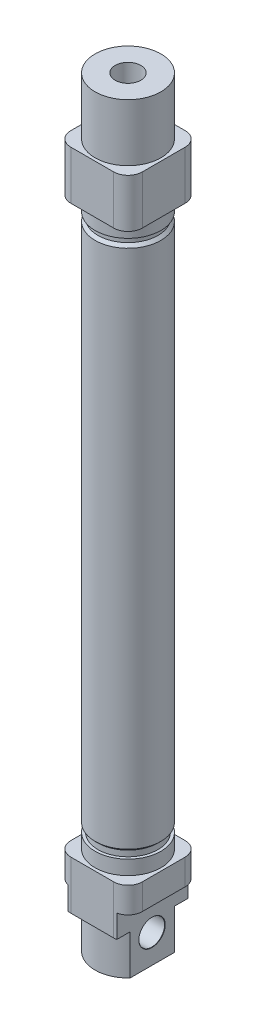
ISO-10303-21;
HEADER;
FILE_DESCRIPTION(('STEP AP214'),'2;1');
FILE_NAME('part.step','',(''),(''),'','','');
FILE_SCHEMA(('AUTOMOTIVE_DESIGN { 1 0 10303 214 1 1 1 1 }'));
ENDSEC;
DATA;
#1=APPLICATION_CONTEXT('core data for automotive mechanical design processes');
#2=APPLICATION_PROTOCOL_DEFINITION('international standard','automotive_design',2000,#1);
#3=PRODUCT_CONTEXT('',#1,'mechanical');
#4=PRODUCT('Part','Part','',(#3));
#5=PRODUCT_RELATED_PRODUCT_CATEGORY('part','',(#4));
#6=PRODUCT_DEFINITION_FORMATION('','',#4);
#7=PRODUCT_DEFINITION_CONTEXT('part definition',#1,'design');
#8=PRODUCT_DEFINITION('design','',#6,#7);
#9=PRODUCT_DEFINITION_SHAPE('','',#8);
#10=(LENGTH_UNIT() NAMED_UNIT(*) SI_UNIT(.MILLI.,.METRE.));
#11=(NAMED_UNIT(*) PLANE_ANGLE_UNIT() SI_UNIT($,.RADIAN.));
#12=(NAMED_UNIT(*) SI_UNIT($,.STERADIAN.) SOLID_ANGLE_UNIT());
#13=UNCERTAINTY_MEASURE_WITH_UNIT(LENGTH_MEASURE(1.E-05),#10,'distance_accuracy_value','');
#14=(GEOMETRIC_REPRESENTATION_CONTEXT(3) GLOBAL_UNCERTAINTY_ASSIGNED_CONTEXT((#13)) GLOBAL_UNIT_ASSIGNED_CONTEXT((#10,
#11,#12)) REPRESENTATION_CONTEXT('',''));
#15=CARTESIAN_POINT('',(0.,0.,0.));
#16=DIRECTION('',(0.,0.,1.));
#17=DIRECTION('',(1.,0.,0.));
#18=AXIS2_PLACEMENT_3D('',#15,#16,#17);
#19=CARTESIAN_POINT('',(-12.5,-17.,-12.5));
#20=DIRECTION('',(0.,-1.,0.));
#21=DIRECTION('',(0.,0.,-1.));
#22=AXIS2_PLACEMENT_3D('',#19,#20,#21);
#23=PLANE('',#22);
#24=DIRECTION('',(0.,0.,1.));
#25=VECTOR('',#24,1.);
#26=CARTESIAN_POINT('',(-8.49999999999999,-17.,-12.5));
#27=LINE('',#26,#25);
#28=CARTESIAN_POINT('',(-8.5,-17.,-12.3989794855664));
#29=VERTEX_POINT('',#28);
#30=CARTESIAN_POINT('',(-8.49999999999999,-17.,-7.74596669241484));
#31=VERTEX_POINT('',#30);
#32=EDGE_CURVE('E241',#29,#31,#27,.T.);
#33=ORIENTED_EDGE('',*,*,#32,.F.);
#34=CARTESIAN_POINT('',(-7.5,-17.,-7.5));
#35=DIRECTION('',(0.,-1.,0.));
#36=DIRECTION('',(0.,0.,-1.));
#37=AXIS2_PLACEMENT_3D('',#34,#35,#36);
#38=CIRCLE('',#37,5.);
#39=CARTESIAN_POINT('',(-7.5,-17.,-12.5));
#40=VERTEX_POINT('',#39);
#41=EDGE_CURVE('E412',#29,#40,#38,.T.);
#42=ORIENTED_EDGE('',*,*,#41,.T.);
#43=DIRECTION('',(1.,0.,0.));
#44=VECTOR('',#43,1.);
#45=CARTESIAN_POINT('',(-12.5,-17.,-12.5));
#46=LINE('',#45,#44);
#47=CARTESIAN_POINT('',(7.5,-17.,-12.5));
#48=VERTEX_POINT('',#47);
#49=EDGE_CURVE('E284',#40,#48,#46,.T.);
#50=ORIENTED_EDGE('',*,*,#49,.T.);
#51=CARTESIAN_POINT('',(7.5,-17.,-7.5));
#52=DIRECTION('',(0.,-1.,0.));
#53=DIRECTION('',(0.,0.,-1.));
#54=AXIS2_PLACEMENT_3D('',#51,#52,#53);
#55=CIRCLE('',#54,5.);
#56=CARTESIAN_POINT('',(8.5,-17.,-12.3989794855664));
#57=VERTEX_POINT('',#56);
#58=EDGE_CURVE('E414',#48,#57,#55,.T.);
#59=ORIENTED_EDGE('',*,*,#58,.T.);
#60=DIRECTION('',(0.,0.,-1.));
#61=VECTOR('',#60,1.);
#62=CARTESIAN_POINT('',(8.5,-17.,-12.5));
#63=LINE('',#62,#61);
#64=CARTESIAN_POINT('',(8.5,-17.,-7.74596669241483));
#65=VERTEX_POINT('',#64);
#66=EDGE_CURVE('E258',#65,#57,#63,.T.);
#67=ORIENTED_EDGE('',*,*,#66,.F.);
#68=CARTESIAN_POINT('',(0.,-17.,0.));
#69=DIRECTION('',(0.,-1.,0.));
#70=DIRECTION('',(0.,0.,-1.));
#71=AXIS2_PLACEMENT_3D('',#68,#69,#70);
#72=CIRCLE('',#71,11.5);
#73=EDGE_CURVE('E269',#31,#65,#72,.T.);
#74=ORIENTED_EDGE('',*,*,#73,.F.);
#75=EDGE_LOOP('',(#33,#42,#50,#59,#67,#74));
#76=FACE_BOUND('',#75,.T.);
#77=ADVANCED_FACE('F33',(#76),#23,.T.);
#78=CARTESIAN_POINT('',(0.,-31.,0.));
#79=DIRECTION('',(0.,1.,0.));
#80=DIRECTION('',(0.,0.,1.));
#81=AXIS2_PLACEMENT_3D('',#78,#79,#80);
#82=CYLINDRICAL_SURFACE('',#81,11.5);
#83=CARTESIAN_POINT('',(0.,-31.,0.));
#84=DIRECTION('',(0.,-1.,0.));
#85=DIRECTION('',(0.,0.,-1.));
#86=AXIS2_PLACEMENT_3D('',#83,#84,#85);
#87=CIRCLE('',#86,11.5);
#88=CARTESIAN_POINT('',(-8.49999999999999,-31.,-7.74596669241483));
#89=VERTEX_POINT('',#88);
#90=CARTESIAN_POINT('',(8.5,-31.,-7.74596669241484));
#91=VERTEX_POINT('',#90);
#92=EDGE_CURVE('E274',#89,#91,#87,.T.);
#93=ORIENTED_EDGE('',*,*,#92,.F.);
#94=DIRECTION('',(0.,1.,0.));
#95=VECTOR('',#94,1.);
#96=CARTESIAN_POINT('',(-8.49999999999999,-31.,-7.74596669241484));
#97=LINE('',#96,#95);
#98=EDGE_CURVE('E246',#89,#31,#97,.T.);
#99=ORIENTED_EDGE('',*,*,#98,.T.);
#100=ORIENTED_EDGE('',*,*,#73,.T.);
#101=DIRECTION('',(0.,1.,0.));
#102=VECTOR('',#101,1.);
#103=CARTESIAN_POINT('',(8.5,-31.,-7.74596669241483));
#104=LINE('',#103,#102);
#105=EDGE_CURVE('E260',#65,#91,#104,.F.);
#106=ORIENTED_EDGE('',*,*,#105,.T.);
#107=EDGE_LOOP('',(#93,#99,#100,#106));
#108=FACE_BOUND('',#107,.T.);
#109=ADVANCED_FACE('F529',(#108),#82,.T.);
#110=CARTESIAN_POINT('',(12.5,-17.,12.5));
#111=DIRECTION('',(-1.,0.,0.));
#112=DIRECTION('',(0.,0.,1.));
#113=AXIS2_PLACEMENT_3D('',#110,#111,#112);
#114=PLANE('',#113);
#115=DIRECTION('',(0.,0.,1.));
#116=VECTOR('',#115,1.);
#117=CARTESIAN_POINT('',(12.5,-9.,12.5));
#118=LINE('',#117,#116);
#119=CARTESIAN_POINT('',(12.5,-9.,-7.5));
#120=VERTEX_POINT('',#119);
#121=CARTESIAN_POINT('',(12.5,-9.,7.5));
#122=VERTEX_POINT('',#121);
#123=EDGE_CURVE('E251',#120,#122,#118,.T.);
#124=ORIENTED_EDGE('',*,*,#123,.F.);
#125=DIRECTION('',(0.,1.,0.));
#126=VECTOR('',#125,1.);
#127=CARTESIAN_POINT('',(12.5,-17.,-7.5));
#128=LINE('',#127,#126);
#129=CARTESIAN_POINT('',(12.5,0.,-7.5));
#130=VERTEX_POINT('',#129);
#131=EDGE_CURVE('E404',#120,#130,#128,.T.);
#132=ORIENTED_EDGE('',*,*,#131,.T.);
#133=DIRECTION('',(0.,0.,1.));
#134=VECTOR('',#133,1.);
#135=CARTESIAN_POINT('',(12.5,0.,12.5));
#136=LINE('',#135,#134);
#137=CARTESIAN_POINT('',(12.5,0.,7.5));
#138=VERTEX_POINT('',#137);
#139=EDGE_CURVE('E297',#130,#138,#136,.T.);
#140=ORIENTED_EDGE('',*,*,#139,.T.);
#141=DIRECTION('',(0.,1.,0.));
#142=VECTOR('',#141,1.);
#143=CARTESIAN_POINT('',(12.5,-17.,7.5));
#144=LINE('',#143,#142);
#145=EDGE_CURVE('E406',#138,#122,#144,.F.);
#146=ORIENTED_EDGE('',*,*,#145,.T.);
#147=EDGE_LOOP('',(#124,#132,#140,#146));
#148=FACE_BOUND('',#147,.T.);
#149=ADVANCED_FACE('F523',(#148),#114,.F.);
#150=CARTESIAN_POINT('',(-8.5,-17.,7.74596669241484));
#151=VERTEX_POINT('',#150);
#152=CARTESIAN_POINT('',(-8.5,-17.,12.3989794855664));
#153=VERTEX_POINT('',#152);
#154=EDGE_CURVE('E238',#151,#153,#27,.T.);
#155=ORIENTED_EDGE('',*,*,#154,.F.);
#156=CARTESIAN_POINT('',(8.5,-17.,7.74596669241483));
#157=VERTEX_POINT('',#156);
#158=EDGE_CURVE('E275',#157,#151,#72,.T.);
#159=ORIENTED_EDGE('',*,*,#158,.F.);
#160=CARTESIAN_POINT('',(8.5,-17.,12.3989794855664));
#161=VERTEX_POINT('',#160);
#162=EDGE_CURVE('E261',#161,#157,#63,.T.);
#163=ORIENTED_EDGE('',*,*,#162,.F.);
#164=CARTESIAN_POINT('',(7.5,-17.,7.5));
#165=DIRECTION('',(0.,-1.,0.));
#166=DIRECTION('',(0.,0.,-1.));
#167=AXIS2_PLACEMENT_3D('',#164,#165,#166);
#168=CIRCLE('',#167,5.);
#169=CARTESIAN_POINT('',(7.5,-17.,12.5));
#170=VERTEX_POINT('',#169);
#171=EDGE_CURVE('E417',#161,#170,#168,.T.);
#172=ORIENTED_EDGE('',*,*,#171,.T.);
#173=DIRECTION('',(-1.,0.,0.));
#174=VECTOR('',#173,1.);
#175=CARTESIAN_POINT('',(-12.5,-17.,12.5));
#176=LINE('',#175,#174);
#177=CARTESIAN_POINT('',(-7.5,-17.,12.5));
#178=VERTEX_POINT('',#177);
#179=EDGE_CURVE('E287',#170,#178,#176,.T.);
#180=ORIENTED_EDGE('',*,*,#179,.T.);
#181=CARTESIAN_POINT('',(-7.5,-17.,7.5));
#182=DIRECTION('',(0.,-1.,0.));
#183=DIRECTION('',(0.,0.,-1.));
#184=AXIS2_PLACEMENT_3D('',#181,#182,#183);
#185=CIRCLE('',#184,5.);
#186=EDGE_CURVE('E409',#178,#153,#185,.T.);
#187=ORIENTED_EDGE('',*,*,#186,.T.);
#188=EDGE_LOOP('',(#155,#159,#163,#172,#180,#187));
#189=FACE_BOUND('',#188,.T.);
#190=ADVANCED_FACE('F513',(#189),#23,.T.);
#191=CARTESIAN_POINT('',(12.5,215.,12.5));
#192=DIRECTION('',(0.,1.,0.));
#193=DIRECTION('',(0.,0.,1.));
#194=AXIS2_PLACEMENT_3D('',#191,#192,#193);
#195=PLANE('',#194);
#196=DIRECTION('',(0.,0.,1.));
#197=VECTOR('',#196,1.);
#198=CARTESIAN_POINT('',(-12.5,215.,-12.5));
#199=LINE('',#198,#197);
#200=CARTESIAN_POINT('',(-12.5,215.,-7.5));
#201=VERTEX_POINT('',#200);
#202=CARTESIAN_POINT('',(-12.5,215.,7.5));
#203=VERTEX_POINT('',#202);
#204=EDGE_CURVE('E312',#201,#203,#199,.T.);
#205=ORIENTED_EDGE('',*,*,#204,.T.);
#206=CARTESIAN_POINT('',(-7.5,215.,7.5));
#207=DIRECTION('',(0.,1.,0.));
#208=DIRECTION('',(0.,0.,1.));
#209=AXIS2_PLACEMENT_3D('',#206,#207,#208);
#210=CIRCLE('',#209,5.);
#211=CARTESIAN_POINT('',(-7.5,215.,12.5));
#212=VERTEX_POINT('',#211);
#213=EDGE_CURVE('E379',#203,#212,#210,.T.);
#214=ORIENTED_EDGE('',*,*,#213,.T.);
#215=DIRECTION('',(1.,0.,0.));
#216=VECTOR('',#215,1.);
#217=CARTESIAN_POINT('',(-12.5,215.,12.5));
#218=LINE('',#217,#216);
#219=CARTESIAN_POINT('',(7.5,215.,12.5));
#220=VERTEX_POINT('',#219);
#221=EDGE_CURVE('E315',#212,#220,#218,.T.);
#222=ORIENTED_EDGE('',*,*,#221,.T.);
#223=CARTESIAN_POINT('',(7.5,215.,7.5));
#224=DIRECTION('',(0.,1.,0.));
#225=DIRECTION('',(0.,0.,1.));
#226=AXIS2_PLACEMENT_3D('',#223,#224,#225);
#227=CIRCLE('',#226,5.);
#228=CARTESIAN_POINT('',(12.5,215.,7.5));
#229=VERTEX_POINT('',#228);
#230=EDGE_CURVE('E373',#220,#229,#227,.T.);
#231=ORIENTED_EDGE('',*,*,#230,.T.);
#232=DIRECTION('',(0.,0.,-1.));
#233=VECTOR('',#232,1.);
#234=CARTESIAN_POINT('',(12.5,215.,-12.5));
#235=LINE('',#234,#233);
#236=CARTESIAN_POINT('',(12.5,215.,-7.5));
#237=VERTEX_POINT('',#236);
#238=EDGE_CURVE('E305',#229,#237,#235,.T.);
#239=ORIENTED_EDGE('',*,*,#238,.T.);
#240=CARTESIAN_POINT('',(7.5,215.,-7.5));
#241=DIRECTION('',(0.,1.,0.));
#242=DIRECTION('',(0.,0.,1.));
#243=AXIS2_PLACEMENT_3D('',#240,#241,#242);
#244=CIRCLE('',#243,5.);
#245=CARTESIAN_POINT('',(7.5,215.,-12.5));
#246=VERTEX_POINT('',#245);
#247=EDGE_CURVE('E375',#237,#246,#244,.T.);
#248=ORIENTED_EDGE('',*,*,#247,.T.);
#249=DIRECTION('',(-1.,0.,0.));
#250=VECTOR('',#249,1.);
#251=CARTESIAN_POINT('',(-12.5,215.,-12.5));
#252=LINE('',#251,#250);
#253=CARTESIAN_POINT('',(-7.5,215.,-12.5));
#254=VERTEX_POINT('',#253);
#255=EDGE_CURVE('E308',#246,#254,#252,.T.);
#256=ORIENTED_EDGE('',*,*,#255,.T.);
#257=CARTESIAN_POINT('',(-7.5,215.,-7.5));
#258=DIRECTION('',(0.,1.,0.));
#259=DIRECTION('',(0.,0.,1.));
#260=AXIS2_PLACEMENT_3D('',#257,#258,#259);
#261=CIRCLE('',#260,5.);
#262=EDGE_CURVE('E377',#254,#201,#261,.T.);
#263=ORIENTED_EDGE('',*,*,#262,.T.);
#264=EDGE_LOOP('',(#205,#214,#222,#231,#239,#248,#256,#263));
#265=FACE_BOUND('',#264,.T.);
#266=CARTESIAN_POINT('',(0.,215.,0.));
#267=DIRECTION('',(0.,1.,0.));
#268=DIRECTION('',(0.,0.,1.));
#269=AXIS2_PLACEMENT_3D('',#266,#267,#268);
#270=CIRCLE('',#269,11.5);
#271=CARTESIAN_POINT('',(0.,215.,11.5));
#272=VERTEX_POINT('',#271);
#273=EDGE_CURVE('E273',#272,#272,#270,.T.);
#274=ORIENTED_EDGE('',*,*,#273,.F.);
#275=EDGE_LOOP('',(#274));
#276=FACE_BOUND('',#275,.T.);
#277=ADVANCED_FACE('F510',(#265,#276),#195,.T.);
#278=CARTESIAN_POINT('',(0.,551.092499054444,0.));
#279=DIRECTION('',(0.,1.,0.));
#280=DIRECTION('',(0.,0.,1.));
#281=AXIS2_PLACEMENT_3D('',#278,#279,#280);
#282=CYLINDRICAL_SURFACE('',#281,11.5000000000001);
#283=CARTESIAN_POINT('',(0.,198.,0.));
#284=DIRECTION('',(0.,1.,0.));
#285=DIRECTION('',(0.,0.,1.));
#286=AXIS2_PLACEMENT_3D('',#283,#284,#285);
#287=CIRCLE('',#286,11.5000000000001);
#288=CARTESIAN_POINT('',(0.,198.,11.5000000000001));
#289=VERTEX_POINT('',#288);
#290=EDGE_CURVE('E352',#289,#289,#287,.T.);
#291=ORIENTED_EDGE('',*,*,#290,.F.);
#292=EDGE_LOOP('',(#291));
#293=FACE_BOUND('',#292,.T.);
#294=CARTESIAN_POINT('',(0.,193.,0.));
#295=DIRECTION('',(0.,1.,0.));
#296=DIRECTION('',(0.,0.,1.));
#297=AXIS2_PLACEMENT_3D('',#294,#295,#296);
#298=CIRCLE('',#297,11.5000000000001);
#299=CARTESIAN_POINT('',(0.,193.,11.5000000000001));
#300=VERTEX_POINT('',#299);
#301=EDGE_CURVE('E349',#300,#300,#298,.T.);
#302=ORIENTED_EDGE('',*,*,#301,.T.);
#303=EDGE_LOOP('',(#302));
#304=FACE_BOUND('',#303,.T.);
#305=ADVANCED_FACE('F512',(#293,#304),#282,.T.);
#306=CARTESIAN_POINT('',(10.5000000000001,193.,0.));
#307=DIRECTION('',(0.,1.,0.));
#308=DIRECTION('',(0.,0.,1.));
#309=AXIS2_PLACEMENT_3D('',#306,#307,#308);
#310=PLANE('',#309);
#311=ORIENTED_EDGE('',*,*,#301,.F.);
#312=EDGE_LOOP('',(#311));
#313=FACE_BOUND('',#312,.T.);
#314=CARTESIAN_POINT('',(0.,193.,0.));
#315=DIRECTION('',(0.,1.,0.));
#316=DIRECTION('',(0.,0.,1.));
#317=AXIS2_PLACEMENT_3D('',#314,#315,#316);
#318=CIRCLE('',#317,10.5000000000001);
#319=CARTESIAN_POINT('',(0.,193.,10.5000000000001));
#320=VERTEX_POINT('',#319);
#321=EDGE_CURVE('E346',#320,#320,#318,.T.);
#322=ORIENTED_EDGE('',*,*,#321,.T.);
#323=EDGE_LOOP('',(#322));
#324=FACE_BOUND('',#323,.T.);
#325=ADVANCED_FACE('F520',(#313,#324),#310,.F.);
#326=CARTESIAN_POINT('',(0.,551.092499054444,0.));
#327=DIRECTION('',(0.,1.,0.));
#328=DIRECTION('',(0.,0.,1.));
#329=AXIS2_PLACEMENT_3D('',#326,#327,#328);
#330=CYLINDRICAL_SURFACE('',#329,10.5000000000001);
#331=ORIENTED_EDGE('',*,*,#321,.F.);
#332=EDGE_LOOP('',(#331));
#333=FACE_BOUND('',#332,.T.);
#334=CARTESIAN_POINT('',(0.,191.,0.));
#335=DIRECTION('',(0.,1.,0.));
#336=DIRECTION('',(0.,0.,1.));
#337=AXIS2_PLACEMENT_3D('',#334,#335,#336);
#338=CIRCLE('',#337,10.5000000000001);
#339=CARTESIAN_POINT('',(0.,191.,10.5000000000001));
#340=VERTEX_POINT('',#339);
#341=EDGE_CURVE('E343',#340,#340,#338,.T.);
#342=ORIENTED_EDGE('',*,*,#341,.T.);
#343=EDGE_LOOP('',(#342));
#344=FACE_BOUND('',#343,.T.);
#345=ADVANCED_FACE('F891',(#333,#344),#330,.T.);
#346=CARTESIAN_POINT('',(0.,190.,0.));
#347=DIRECTION('',(0.,-1.,0.));
#348=DIRECTION('',(0.,0.,-1.));
#349=AXIS2_PLACEMENT_3D('',#346,#347,#348);
#350=CONICAL_SURFACE('',#349,11.5,0.78539816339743);
#351=ORIENTED_EDGE('',*,*,#341,.F.);
#352=EDGE_LOOP('',(#351));
#353=FACE_BOUND('',#352,.T.);
#354=CARTESIAN_POINT('',(0.,190.,0.));
#355=DIRECTION('',(0.,1.,0.));
#356=DIRECTION('',(0.,0.,1.));
#357=AXIS2_PLACEMENT_3D('',#354,#355,#356);
#358=CIRCLE('',#357,11.5);
#359=CARTESIAN_POINT('',(0.,190.,11.5));
#360=VERTEX_POINT('',#359);
#361=EDGE_CURVE('E340',#360,#360,#358,.T.);
#362=ORIENTED_EDGE('',*,*,#361,.T.);
#363=EDGE_LOOP('',(#362));
#364=FACE_BOUND('',#363,.T.);
#365=ADVANCED_FACE('F897',(#353,#364),#350,.T.);
#366=CARTESIAN_POINT('',(0.,551.092499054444,0.));
#367=DIRECTION('',(0.,1.,0.));
#368=DIRECTION('',(0.,0.,1.));
#369=AXIS2_PLACEMENT_3D('',#366,#367,#368);
#370=CYLINDRICAL_SURFACE('',#369,11.5);
#371=ORIENTED_EDGE('',*,*,#361,.F.);
#372=EDGE_LOOP('',(#371));
#373=FACE_BOUND('',#372,.T.);
#374=CARTESIAN_POINT('',(0.,8.00000000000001,0.));
#375=DIRECTION('',(0.,1.,0.));
#376=DIRECTION('',(0.,0.,1.));
#377=AXIS2_PLACEMENT_3D('',#374,#375,#376);
#378=CIRCLE('',#377,11.5);
#379=CARTESIAN_POINT('',(0.,8.00000000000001,11.5));
#380=VERTEX_POINT('',#379);
#381=EDGE_CURVE('E337',#380,#380,#378,.T.);
#382=ORIENTED_EDGE('',*,*,#381,.T.);
#383=EDGE_LOOP('',(#382));
#384=FACE_BOUND('',#383,.T.);
#385=ADVANCED_FACE('F903',(#373,#384),#370,.T.);
#386=CARTESIAN_POINT('',(0.,7.00000000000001,0.));
#387=DIRECTION('',(0.,1.,0.));
#388=DIRECTION('',(0.,0.,1.));
#389=AXIS2_PLACEMENT_3D('',#386,#387,#388);
#390=CONICAL_SURFACE('',#389,10.5,0.785398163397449);
#391=ORIENTED_EDGE('',*,*,#381,.F.);
#392=EDGE_LOOP('',(#391));
#393=FACE_BOUND('',#392,.T.);
#394=CARTESIAN_POINT('',(0.,7.00000000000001,0.));
#395=DIRECTION('',(0.,1.,0.));
#396=DIRECTION('',(0.,0.,1.));
#397=AXIS2_PLACEMENT_3D('',#394,#395,#396);
#398=CIRCLE('',#397,10.5);
#399=CARTESIAN_POINT('',(0.,7.00000000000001,10.5));
#400=VERTEX_POINT('',#399);
#401=EDGE_CURVE('E334',#400,#400,#398,.T.);
#402=ORIENTED_EDGE('',*,*,#401,.T.);
#403=EDGE_LOOP('',(#402));
#404=FACE_BOUND('',#403,.T.);
#405=ADVANCED_FACE('F909',(#393,#404),#390,.T.);
#406=CARTESIAN_POINT('',(0.,551.092499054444,0.));
#407=DIRECTION('',(0.,1.,0.));
#408=DIRECTION('',(0.,0.,1.));
#409=AXIS2_PLACEMENT_3D('',#406,#407,#408);
#410=CYLINDRICAL_SURFACE('',#409,10.5);
#411=ORIENTED_EDGE('',*,*,#401,.F.);
#412=EDGE_LOOP('',(#411));
#413=FACE_BOUND('',#412,.T.);
#414=CARTESIAN_POINT('',(0.,5.,0.));
#415=DIRECTION('',(0.,1.,0.));
#416=DIRECTION('',(0.,0.,1.));
#417=AXIS2_PLACEMENT_3D('',#414,#415,#416);
#418=CIRCLE('',#417,10.5);
#419=CARTESIAN_POINT('',(0.,5.,10.5));
#420=VERTEX_POINT('',#419);
#421=EDGE_CURVE('E331',#420,#420,#418,.T.);
#422=ORIENTED_EDGE('',*,*,#421,.T.);
#423=EDGE_LOOP('',(#422));
#424=FACE_BOUND('',#423,.T.);
#425=ADVANCED_FACE('F915',(#413,#424),#410,.T.);
#426=CARTESIAN_POINT('',(10.5,5.,0.));
#427=DIRECTION('',(0.,-1.,0.));
#428=DIRECTION('',(0.,0.,-1.));
#429=AXIS2_PLACEMENT_3D('',#426,#427,#428);
#430=PLANE('',#429);
#431=ORIENTED_EDGE('',*,*,#421,.F.);
#432=EDGE_LOOP('',(#431));
#433=FACE_BOUND('',#432,.T.);
#434=CARTESIAN_POINT('',(0.,5.,0.));
#435=DIRECTION('',(0.,1.,0.));
#436=DIRECTION('',(0.,0.,1.));
#437=AXIS2_PLACEMENT_3D('',#434,#435,#436);
#438=CIRCLE('',#437,11.5);
#439=CARTESIAN_POINT('',(0.,5.,11.5));
#440=VERTEX_POINT('',#439);
#441=EDGE_CURVE('E318',#440,#440,#438,.T.);
#442=ORIENTED_EDGE('',*,*,#441,.T.);
#443=EDGE_LOOP('',(#442));
#444=FACE_BOUND('',#443,.T.);
#445=ADVANCED_FACE('F921',(#433,#444),#430,.F.);
#446=CARTESIAN_POINT('',(0.,551.092499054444,0.));
#447=DIRECTION('',(0.,1.,0.));
#448=DIRECTION('',(0.,0.,1.));
#449=AXIS2_PLACEMENT_3D('',#446,#447,#448);
#450=CYLINDRICAL_SURFACE('',#449,11.5);
#451=ORIENTED_EDGE('',*,*,#441,.F.);
#452=EDGE_LOOP('',(#451));
#453=FACE_BOUND('',#452,.T.);
#454=CARTESIAN_POINT('',(0.,0.,0.));
#455=DIRECTION('',(0.,-1.,0.));
#456=DIRECTION('',(0.,0.,-1.));
#457=AXIS2_PLACEMENT_3D('',#454,#455,#456);
#458=CIRCLE('',#457,11.5);
#459=CARTESIAN_POINT('',(0.,0.,-11.5));
#460=VERTEX_POINT('',#459);
#461=EDGE_CURVE('E291',#460,#460,#458,.T.);
#462=ORIENTED_EDGE('',*,*,#461,.F.);
#463=EDGE_LOOP('',(#462));
#464=FACE_BOUND('',#463,.T.);
#465=ADVANCED_FACE('F884',(#453,#464),#450,.T.);
#466=CARTESIAN_POINT('',(12.5,198.,12.5));
#467=DIRECTION('',(0.,1.,0.));
#468=DIRECTION('',(0.,0.,1.));
#469=AXIS2_PLACEMENT_3D('',#466,#467,#468);
#470=PLANE('',#469);
#471=DIRECTION('',(1.,0.,0.));
#472=VECTOR('',#471,1.);
#473=CARTESIAN_POINT('',(-12.5,198.,12.5));
#474=LINE('',#473,#472);
#475=CARTESIAN_POINT('',(-7.5,198.,12.5));
#476=VERTEX_POINT('',#475);
#477=CARTESIAN_POINT('',(7.5,198.,12.5));
#478=VERTEX_POINT('',#477);
#479=EDGE_CURVE('E309',#476,#478,#474,.T.);
#480=ORIENTED_EDGE('',*,*,#479,.F.);
#481=CARTESIAN_POINT('',(-7.5,198.,7.5));
#482=DIRECTION('',(0.,1.,0.));
#483=DIRECTION('',(0.,0.,1.));
#484=AXIS2_PLACEMENT_3D('',#481,#482,#483);
#485=CIRCLE('',#484,5.);
#486=CARTESIAN_POINT('',(-12.5,198.,7.5));
#487=VERTEX_POINT('',#486);
#488=EDGE_CURVE('E366',#476,#487,#485,.F.);
#489=ORIENTED_EDGE('',*,*,#488,.T.);
#490=DIRECTION('',(0.,0.,1.));
#491=VECTOR('',#490,1.);
#492=CARTESIAN_POINT('',(-12.5,198.,-12.5));
#493=LINE('',#492,#491);
#494=CARTESIAN_POINT('',(-12.5,198.,-7.5));
#495=VERTEX_POINT('',#494);
#496=EDGE_CURVE('E324',#495,#487,#493,.T.);
#497=ORIENTED_EDGE('',*,*,#496,.F.);
#498=CARTESIAN_POINT('',(-7.5,198.,-7.5));
#499=DIRECTION('',(0.,1.,0.));
#500=DIRECTION('',(0.,0.,1.));
#501=AXIS2_PLACEMENT_3D('',#498,#499,#500);
#502=CIRCLE('',#501,5.);
#503=CARTESIAN_POINT('',(-7.5,198.,-12.5));
#504=VERTEX_POINT('',#503);
#505=EDGE_CURVE('E364',#495,#504,#502,.F.);
#506=ORIENTED_EDGE('',*,*,#505,.T.);
#507=DIRECTION('',(-1.,0.,0.));
#508=VECTOR('',#507,1.);
#509=CARTESIAN_POINT('',(-12.5,198.,-12.5));
#510=LINE('',#509,#508);
#511=CARTESIAN_POINT('',(7.5,198.,-12.5));
#512=VERTEX_POINT('',#511);
#513=EDGE_CURVE('E321',#512,#504,#510,.T.);
#514=ORIENTED_EDGE('',*,*,#513,.F.);
#515=CARTESIAN_POINT('',(7.5,198.,-7.5));
#516=DIRECTION('',(0.,1.,0.));
#517=DIRECTION('',(0.,0.,1.));
#518=AXIS2_PLACEMENT_3D('',#515,#516,#517);
#519=CIRCLE('',#518,5.);
#520=CARTESIAN_POINT('',(12.5,198.,-7.5));
#521=VERTEX_POINT('',#520);
#522=EDGE_CURVE('E362',#512,#521,#519,.F.);
#523=ORIENTED_EDGE('',*,*,#522,.T.);
#524=DIRECTION('',(0.,0.,-1.));
#525=VECTOR('',#524,1.);
#526=CARTESIAN_POINT('',(12.5,198.,-12.5));
#527=LINE('',#526,#525);
#528=CARTESIAN_POINT('',(12.5,198.,7.5));
#529=VERTEX_POINT('',#528);
#530=EDGE_CURVE('E304',#529,#521,#527,.T.);
#531=ORIENTED_EDGE('',*,*,#530,.F.);
#532=CARTESIAN_POINT('',(7.5,198.,7.5));
#533=DIRECTION('',(0.,1.,0.));
#534=DIRECTION('',(0.,0.,1.));
#535=AXIS2_PLACEMENT_3D('',#532,#533,#534);
#536=CIRCLE('',#535,5.);
#537=EDGE_CURVE('E360',#529,#478,#536,.F.);
#538=ORIENTED_EDGE('',*,*,#537,.T.);
#539=EDGE_LOOP('',(#480,#489,#497,#506,#514,#523,#531,#538));
#540=FACE_BOUND('',#539,.T.);
#541=ORIENTED_EDGE('',*,*,#290,.T.);
#542=EDGE_LOOP('',(#541));
#543=FACE_BOUND('',#542,.T.);
#544=ADVANCED_FACE('F881',(#540,#543),#470,.F.);
#545=CARTESIAN_POINT('',(12.5,215.,-12.5));
#546=DIRECTION('',(-1.,0.,0.));
#547=DIRECTION('',(0.,0.,1.));
#548=AXIS2_PLACEMENT_3D('',#545,#546,#547);
#549=PLANE('',#548);
#550=ORIENTED_EDGE('',*,*,#530,.T.);
#551=DIRECTION('',(0.,-1.,0.));
#552=VECTOR('',#551,1.);
#553=CARTESIAN_POINT('',(12.5,215.,-7.5));
#554=LINE('',#553,#552);
#555=EDGE_CURVE('E389',#521,#237,#554,.F.);
#556=ORIENTED_EDGE('',*,*,#555,.T.);
#557=ORIENTED_EDGE('',*,*,#238,.F.);
#558=DIRECTION('',(0.,-1.,0.));
#559=VECTOR('',#558,1.);
#560=CARTESIAN_POINT('',(12.5,215.,7.5));
#561=LINE('',#560,#559);
#562=EDGE_CURVE('E386',#229,#529,#561,.T.);
#563=ORIENTED_EDGE('',*,*,#562,.T.);
#564=EDGE_LOOP('',(#550,#556,#557,#563));
#565=FACE_BOUND('',#564,.T.);
#566=ADVANCED_FACE('F768',(#565),#549,.F.);
#567=CARTESIAN_POINT('',(-12.5,215.,-12.5));
#568=DIRECTION('',(0.,0.,1.));
#569=DIRECTION('',(1.,0.,0.));
#570=AXIS2_PLACEMENT_3D('',#567,#568,#569);
#571=PLANE('',#570);
#572=CARTESIAN_POINT('',(0.,206.,-12.5));
#573=DIRECTION('',(0.,0.,-1.));
#574=DIRECTION('',(-1.,0.,0.));
#575=AXIS2_PLACEMENT_3D('',#572,#573,#574);
#576=CIRCLE('',#575,5.09999999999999);
#577=CARTESIAN_POINT('',(-5.09999999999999,206.,-12.5));
#578=VERTEX_POINT('',#577);
#579=EDGE_CURVE('E214',#578,#578,#576,.T.);
#580=ORIENTED_EDGE('',*,*,#579,.F.);
#581=EDGE_LOOP('',(#580));
#582=FACE_BOUND('',#581,.T.);
#583=ORIENTED_EDGE('',*,*,#513,.T.);
#584=DIRECTION('',(0.,-1.,0.));
#585=VECTOR('',#584,1.);
#586=CARTESIAN_POINT('',(-7.5,215.,-12.5));
#587=LINE('',#586,#585);
#588=EDGE_CURVE('E384',#504,#254,#587,.F.);
#589=ORIENTED_EDGE('',*,*,#588,.T.);
#590=ORIENTED_EDGE('',*,*,#255,.F.);
#591=DIRECTION('',(0.,-1.,0.));
#592=VECTOR('',#591,1.);
#593=CARTESIAN_POINT('',(7.5,215.,-12.5));
#594=LINE('',#593,#592);
#595=EDGE_CURVE('E381',#246,#512,#594,.T.);
#596=ORIENTED_EDGE('',*,*,#595,.T.);
#597=EDGE_LOOP('',(#583,#589,#590,#596));
#598=FACE_BOUND('',#597,.T.);
#599=ADVANCED_FACE('F762',(#582,#598),#571,.F.);
#600=CARTESIAN_POINT('',(-12.5,215.,-12.5));
#601=DIRECTION('',(1.,0.,0.));
#602=DIRECTION('',(0.,0.,-1.));
#603=AXIS2_PLACEMENT_3D('',#600,#601,#602);
#604=PLANE('',#603);
#605=ORIENTED_EDGE('',*,*,#496,.T.);
#606=DIRECTION('',(0.,-1.,0.));
#607=VECTOR('',#606,1.);
#608=CARTESIAN_POINT('',(-12.5,215.,7.5));
#609=LINE('',#608,#607);
#610=EDGE_CURVE('E371',#487,#203,#609,.F.);
#611=ORIENTED_EDGE('',*,*,#610,.T.);
#612=ORIENTED_EDGE('',*,*,#204,.F.);
#613=DIRECTION('',(0.,-1.,0.));
#614=VECTOR('',#613,1.);
#615=CARTESIAN_POINT('',(-12.5,215.,-7.5));
#616=LINE('',#615,#614);
#617=EDGE_CURVE('E368',#201,#495,#616,.T.);
#618=ORIENTED_EDGE('',*,*,#617,.T.);
#619=EDGE_LOOP('',(#605,#611,#612,#618));
#620=FACE_BOUND('',#619,.T.);
#621=ADVANCED_FACE('F767',(#620),#604,.F.);
#622=CARTESIAN_POINT('',(-12.5,215.,12.5));
#623=DIRECTION('',(0.,0.,-1.));
#624=DIRECTION('',(-1.,0.,0.));
#625=AXIS2_PLACEMENT_3D('',#622,#623,#624);
#626=PLANE('',#625);
#627=ORIENTED_EDGE('',*,*,#221,.F.);
#628=DIRECTION('',(0.,-1.,0.));
#629=VECTOR('',#628,1.);
#630=CARTESIAN_POINT('',(-7.5,215.,12.5));
#631=LINE('',#630,#629);
#632=EDGE_CURVE('E357',#212,#476,#631,.T.);
#633=ORIENTED_EDGE('',*,*,#632,.T.);
#634=ORIENTED_EDGE('',*,*,#479,.T.);
#635=DIRECTION('',(0.,-1.,0.));
#636=VECTOR('',#635,1.);
#637=CARTESIAN_POINT('',(7.5,215.,12.5));
#638=LINE('',#637,#636);
#639=EDGE_CURVE('E355',#478,#220,#638,.F.);
#640=ORIENTED_EDGE('',*,*,#639,.T.);
#641=EDGE_LOOP('',(#627,#633,#634,#640));
#642=FACE_BOUND('',#641,.T.);
#643=ADVANCED_FACE('F542',(#642),#626,.F.);
#644=CARTESIAN_POINT('',(-12.5,0.,-12.5));
#645=DIRECTION('',(0.,-1.,0.));
#646=DIRECTION('',(0.,0.,-1.));
#647=AXIS2_PLACEMENT_3D('',#644,#645,#646);
#648=PLANE('',#647);
#649=DIRECTION('',(-1.,0.,0.));
#650=VECTOR('',#649,1.);
#651=CARTESIAN_POINT('',(-12.5,0.,12.5));
#652=LINE('',#651,#650);
#653=CARTESIAN_POINT('',(7.5,0.,12.5));
#654=VERTEX_POINT('',#653);
#655=CARTESIAN_POINT('',(-7.5,0.,12.5));
#656=VERTEX_POINT('',#655);
#657=EDGE_CURVE('E288',#654,#656,#652,.T.);
#658=ORIENTED_EDGE('',*,*,#657,.F.);
#659=CARTESIAN_POINT('',(7.5,0.,7.5));
#660=DIRECTION('',(0.,-1.,0.));
#661=DIRECTION('',(0.,0.,-1.));
#662=AXIS2_PLACEMENT_3D('',#659,#660,#661);
#663=CIRCLE('',#662,5.);
#664=EDGE_CURVE('E402',#654,#138,#663,.F.);
#665=ORIENTED_EDGE('',*,*,#664,.T.);
#666=ORIENTED_EDGE('',*,*,#139,.F.);
#667=CARTESIAN_POINT('',(7.5,0.,-7.5));
#668=DIRECTION('',(0.,-1.,0.));
#669=DIRECTION('',(0.,0.,-1.));
#670=AXIS2_PLACEMENT_3D('',#667,#668,#669);
#671=CIRCLE('',#670,5.);
#672=CARTESIAN_POINT('',(7.5,0.,-12.5));
#673=VERTEX_POINT('',#672);
#674=EDGE_CURVE('E400',#130,#673,#671,.F.);
#675=ORIENTED_EDGE('',*,*,#674,.T.);
#676=DIRECTION('',(1.,0.,0.));
#677=VECTOR('',#676,1.);
#678=CARTESIAN_POINT('',(-12.5,0.,-12.5));
#679=LINE('',#678,#677);
#680=CARTESIAN_POINT('',(-7.5,0.,-12.5));
#681=VERTEX_POINT('',#680);
#682=EDGE_CURVE('E294',#681,#673,#679,.T.);
#683=ORIENTED_EDGE('',*,*,#682,.F.);
#684=CARTESIAN_POINT('',(-7.5,0.,-7.5));
#685=DIRECTION('',(0.,-1.,0.));
#686=DIRECTION('',(0.,0.,-1.));
#687=AXIS2_PLACEMENT_3D('',#684,#685,#686);
#688=CIRCLE('',#687,5.);
#689=CARTESIAN_POINT('',(-12.5,0.,-7.5));
#690=VERTEX_POINT('',#689);
#691=EDGE_CURVE('E398',#681,#690,#688,.F.);
#692=ORIENTED_EDGE('',*,*,#691,.T.);
#693=DIRECTION('',(0.,0.,-1.));
#694=VECTOR('',#693,1.);
#695=CARTESIAN_POINT('',(-12.5,0.,12.5));
#696=LINE('',#695,#694);
#697=CARTESIAN_POINT('',(-12.5,0.,7.5));
#698=VERTEX_POINT('',#697);
#699=EDGE_CURVE('E281',#698,#690,#696,.T.);
#700=ORIENTED_EDGE('',*,*,#699,.F.);
#701=CARTESIAN_POINT('',(-7.5,0.,7.5));
#702=DIRECTION('',(0.,-1.,0.));
#703=DIRECTION('',(0.,0.,-1.));
#704=AXIS2_PLACEMENT_3D('',#701,#702,#703);
#705=CIRCLE('',#704,5.);
#706=EDGE_CURVE('E396',#698,#656,#705,.F.);
#707=ORIENTED_EDGE('',*,*,#706,.T.);
#708=EDGE_LOOP('',(#658,#665,#666,#675,#683,#692,#700,#707));
#709=FACE_BOUND('',#708,.T.);
#710=ORIENTED_EDGE('',*,*,#461,.T.);
#711=EDGE_LOOP('',(#710));
#712=FACE_BOUND('',#711,.T.);
#713=ADVANCED_FACE('F538',(#709,#712),#648,.F.);
#714=CARTESIAN_POINT('',(-12.5,-17.,12.5));
#715=DIRECTION('',(1.,0.,0.));
#716=DIRECTION('',(0.,0.,-1.));
#717=AXIS2_PLACEMENT_3D('',#714,#715,#716);
#718=PLANE('',#717);
#719=DIRECTION('',(0.,1.,0.));
#720=VECTOR('',#719,1.);
#721=CARTESIAN_POINT('',(-12.5,-17.,-7.5));
#722=LINE('',#721,#720);
#723=CARTESIAN_POINT('',(-12.5,-9.,-7.5));
#724=VERTEX_POINT('',#723);
#725=EDGE_CURVE('E426',#690,#724,#722,.F.);
#726=ORIENTED_EDGE('',*,*,#725,.T.);
#727=DIRECTION('',(0.,0.,1.));
#728=VECTOR('',#727,1.);
#729=CARTESIAN_POINT('',(-12.5,-9.,12.5));
#730=LINE('',#729,#728);
#731=CARTESIAN_POINT('',(-12.5,-9.,7.5));
#732=VERTEX_POINT('',#731);
#733=EDGE_CURVE('E232',#724,#732,#730,.T.);
#734=ORIENTED_EDGE('',*,*,#733,.T.);
#735=DIRECTION('',(0.,1.,0.));
#736=VECTOR('',#735,1.);
#737=CARTESIAN_POINT('',(-12.5,-17.,7.5));
#738=LINE('',#737,#736);
#739=EDGE_CURVE('E424',#732,#698,#738,.T.);
#740=ORIENTED_EDGE('',*,*,#739,.T.);
#741=ORIENTED_EDGE('',*,*,#699,.T.);
#742=EDGE_LOOP('',(#726,#734,#740,#741));
#743=FACE_BOUND('',#742,.T.);
#744=ADVANCED_FACE('F541',(#743),#718,.F.);
#745=CARTESIAN_POINT('',(-12.5,-17.,-12.5));
#746=DIRECTION('',(0.,0.,1.));
#747=DIRECTION('',(1.,0.,0.));
#748=AXIS2_PLACEMENT_3D('',#745,#746,#747);
#749=PLANE('',#748);
#750=CARTESIAN_POINT('',(0.,-9.,-12.5));
#751=DIRECTION('',(0.,0.,-1.));
#752=DIRECTION('',(-1.,0.,0.));
#753=AXIS2_PLACEMENT_3D('',#750,#751,#752);
#754=CIRCLE('',#753,5.09999999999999);
#755=CARTESIAN_POINT('',(-5.09999999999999,-9.,-12.5));
#756=VERTEX_POINT('',#755);
#757=EDGE_CURVE('E227',#756,#756,#754,.T.);
#758=ORIENTED_EDGE('',*,*,#757,.F.);
#759=EDGE_LOOP('',(#758));
#760=FACE_BOUND('',#759,.T.);
#761=ORIENTED_EDGE('',*,*,#682,.T.);
#762=DIRECTION('',(0.,1.,0.));
#763=VECTOR('',#762,1.);
#764=CARTESIAN_POINT('',(7.5,-17.,-12.5));
#765=LINE('',#764,#763);
#766=EDGE_CURVE('E422',#673,#48,#765,.F.);
#767=ORIENTED_EDGE('',*,*,#766,.T.);
#768=ORIENTED_EDGE('',*,*,#49,.F.);
#769=DIRECTION('',(0.,1.,0.));
#770=VECTOR('',#769,1.);
#771=CARTESIAN_POINT('',(-7.5,-17.,-12.5));
#772=LINE('',#771,#770);
#773=EDGE_CURVE('E419',#40,#681,#772,.T.);
#774=ORIENTED_EDGE('',*,*,#773,.T.);
#775=EDGE_LOOP('',(#761,#767,#768,#774));
#776=FACE_BOUND('',#775,.T.);
#777=ADVANCED_FACE('F546',(#760,#776),#749,.F.);
#778=CARTESIAN_POINT('',(-12.5,-17.,12.5));
#779=DIRECTION('',(0.,0.,-1.));
#780=DIRECTION('',(-1.,0.,0.));
#781=AXIS2_PLACEMENT_3D('',#778,#779,#780);
#782=PLANE('',#781);
#783=ORIENTED_EDGE('',*,*,#179,.F.);
#784=DIRECTION('',(0.,1.,0.));
#785=VECTOR('',#784,1.);
#786=CARTESIAN_POINT('',(7.5,-17.,12.5));
#787=LINE('',#786,#785);
#788=EDGE_CURVE('E393',#170,#654,#787,.T.);
#789=ORIENTED_EDGE('',*,*,#788,.T.);
#790=ORIENTED_EDGE('',*,*,#657,.T.);
#791=DIRECTION('',(0.,1.,0.));
#792=VECTOR('',#791,1.);
#793=CARTESIAN_POINT('',(-7.5,-17.,12.5));
#794=LINE('',#793,#792);
#795=EDGE_CURVE('E391',#656,#178,#794,.F.);
#796=ORIENTED_EDGE('',*,*,#795,.T.);
#797=EDGE_LOOP('',(#783,#789,#790,#796));
#798=FACE_BOUND('',#797,.T.);
#799=ADVANCED_FACE('F506',(#798),#782,.F.);
#800=CARTESIAN_POINT('',(0.,235.,0.));
#801=DIRECTION('',(0.,-1.,0.));
#802=DIRECTION('',(0.,0.,-1.));
#803=AXIS2_PLACEMENT_3D('',#800,#801,#802);
#804=CYLINDRICAL_SURFACE('',#803,11.5);
#805=CARTESIAN_POINT('',(0.,235.,0.));
#806=DIRECTION('',(0.,1.,0.));
#807=DIRECTION('',(0.,0.,1.));
#808=AXIS2_PLACEMENT_3D('',#805,#806,#807);
#809=CIRCLE('',#808,11.5);
#810=CARTESIAN_POINT('',(0.,235.,11.5));
#811=VERTEX_POINT('',#810);
#812=EDGE_CURVE('E278',#811,#811,#809,.T.);
#813=ORIENTED_EDGE('',*,*,#812,.F.);
#814=EDGE_LOOP('',(#813));
#815=FACE_BOUND('',#814,.T.);
#816=ORIENTED_EDGE('',*,*,#273,.T.);
#817=EDGE_LOOP('',(#816));
#818=FACE_BOUND('',#817,.T.);
#819=ADVANCED_FACE('F500',(#815,#818),#804,.T.);
#820=CARTESIAN_POINT('',(0.,235.,0.));
#821=DIRECTION('',(0.,1.,0.));
#822=DIRECTION('',(0.,0.,1.));
#823=AXIS2_PLACEMENT_3D('',#820,#821,#822);
#824=PLANE('',#823);
#825=CARTESIAN_POINT('',(0.,235.,0.));
#826=DIRECTION('',(0.,1.,0.));
#827=DIRECTION('',(0.,0.,1.));
#828=AXIS2_PLACEMENT_3D('',#825,#826,#827);
#829=CIRCLE('',#828,4.5);
#830=CARTESIAN_POINT('',(0.,235.,4.5));
#831=VERTEX_POINT('',#830);
#832=EDGE_CURVE('E222',#831,#831,#829,.T.);
#833=ORIENTED_EDGE('',*,*,#832,.F.);
#834=EDGE_LOOP('',(#833));
#835=FACE_BOUND('',#834,.T.);
#836=ORIENTED_EDGE('',*,*,#812,.T.);
#837=EDGE_LOOP('',(#836));
#838=FACE_BOUND('',#837,.T.);
#839=ADVANCED_FACE('F496',(#835,#838),#824,.T.);
#840=ORIENTED_EDGE('',*,*,#158,.T.);
#841=DIRECTION('',(0.,1.,0.));
#842=VECTOR('',#841,1.);
#843=CARTESIAN_POINT('',(-8.5,-31.,7.74596669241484));
#844=LINE('',#843,#842);
#845=CARTESIAN_POINT('',(-8.5,-31.,7.74596669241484));
#846=VERTEX_POINT('',#845);
#847=EDGE_CURVE('E240',#151,#846,#844,.F.);
#848=ORIENTED_EDGE('',*,*,#847,.T.);
#849=CARTESIAN_POINT('',(8.5,-31.,7.74596669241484));
#850=VERTEX_POINT('',#849);
#851=EDGE_CURVE('E270',#850,#846,#87,.T.);
#852=ORIENTED_EDGE('',*,*,#851,.F.);
#853=DIRECTION('',(0.,1.,0.));
#854=VECTOR('',#853,1.);
#855=CARTESIAN_POINT('',(8.5,-31.,7.74596669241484));
#856=LINE('',#855,#854);
#857=EDGE_CURVE('E266',#850,#157,#856,.T.);
#858=ORIENTED_EDGE('',*,*,#857,.T.);
#859=EDGE_LOOP('',(#840,#848,#852,#858));
#860=FACE_BOUND('',#859,.T.);
#861=ADVANCED_FACE('F499',(#860),#82,.T.);
#862=CARTESIAN_POINT('',(0.,-31.,0.));
#863=DIRECTION('',(0.,-1.,0.));
#864=DIRECTION('',(0.,0.,-1.));
#865=AXIS2_PLACEMENT_3D('',#862,#863,#864);
#866=PLANE('',#865);
#867=DIRECTION('',(0.,0.,1.));
#868=VECTOR('',#867,1.);
#869=CARTESIAN_POINT('',(-8.5,-31.,13.4444444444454));
#870=LINE('',#869,#868);
#871=EDGE_CURVE('E230',#89,#846,#870,.T.);
#872=ORIENTED_EDGE('',*,*,#871,.F.);
#873=ORIENTED_EDGE('',*,*,#92,.T.);
#874=DIRECTION('',(0.,0.,-1.));
#875=VECTOR('',#874,1.);
#876=CARTESIAN_POINT('',(8.5,-31.,13.4444444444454));
#877=LINE('',#876,#875);
#878=EDGE_CURVE('E249',#850,#91,#877,.T.);
#879=ORIENTED_EDGE('',*,*,#878,.F.);
#880=ORIENTED_EDGE('',*,*,#851,.T.);
#881=EDGE_LOOP('',(#872,#873,#879,#880));
#882=FACE_BOUND('',#881,.T.);
#883=ADVANCED_FACE('F597',(#882),#866,.T.);
#884=CARTESIAN_POINT('',(-7.5,215.,7.5));
#885=DIRECTION('',(0.,-1.,0.));
#886=DIRECTION('',(0.,0.,-1.));
#887=AXIS2_PLACEMENT_3D('',#884,#885,#886);
#888=CYLINDRICAL_SURFACE('',#887,5.);
#889=ORIENTED_EDGE('',*,*,#213,.F.);
#890=ORIENTED_EDGE('',*,*,#610,.F.);
#891=ORIENTED_EDGE('',*,*,#488,.F.);
#892=ORIENTED_EDGE('',*,*,#632,.F.);
#893=EDGE_LOOP('',(#889,#890,#891,#892));
#894=FACE_BOUND('',#893,.T.);
#895=ADVANCED_FACE('F626',(#894),#888,.T.);
#896=CARTESIAN_POINT('',(-7.5,215.,-7.5));
#897=DIRECTION('',(0.,-1.,0.));
#898=DIRECTION('',(0.,0.,-1.));
#899=AXIS2_PLACEMENT_3D('',#896,#897,#898);
#900=CYLINDRICAL_SURFACE('',#899,5.);
#901=ORIENTED_EDGE('',*,*,#262,.F.);
#902=ORIENTED_EDGE('',*,*,#588,.F.);
#903=ORIENTED_EDGE('',*,*,#505,.F.);
#904=ORIENTED_EDGE('',*,*,#617,.F.);
#905=EDGE_LOOP('',(#901,#902,#903,#904));
#906=FACE_BOUND('',#905,.T.);
#907=ADVANCED_FACE('F643',(#906),#900,.T.);
#908=CARTESIAN_POINT('',(7.5,215.,-7.5));
#909=DIRECTION('',(0.,-1.,0.));
#910=DIRECTION('',(0.,0.,-1.));
#911=AXIS2_PLACEMENT_3D('',#908,#909,#910);
#912=CYLINDRICAL_SURFACE('',#911,5.);
#913=ORIENTED_EDGE('',*,*,#247,.F.);
#914=ORIENTED_EDGE('',*,*,#555,.F.);
#915=ORIENTED_EDGE('',*,*,#522,.F.);
#916=ORIENTED_EDGE('',*,*,#595,.F.);
#917=EDGE_LOOP('',(#913,#914,#915,#916));
#918=FACE_BOUND('',#917,.T.);
#919=ADVANCED_FACE('F652',(#918),#912,.T.);
#920=CARTESIAN_POINT('',(7.5,215.,7.5));
#921=DIRECTION('',(0.,-1.,0.));
#922=DIRECTION('',(0.,0.,-1.));
#923=AXIS2_PLACEMENT_3D('',#920,#921,#922);
#924=CYLINDRICAL_SURFACE('',#923,5.);
#925=ORIENTED_EDGE('',*,*,#230,.F.);
#926=ORIENTED_EDGE('',*,*,#639,.F.);
#927=ORIENTED_EDGE('',*,*,#537,.F.);
#928=ORIENTED_EDGE('',*,*,#562,.F.);
#929=EDGE_LOOP('',(#925,#926,#927,#928));
#930=FACE_BOUND('',#929,.T.);
#931=ADVANCED_FACE('F660',(#930),#924,.T.);
#932=CARTESIAN_POINT('',(7.5,-17.,7.5));
#933=DIRECTION('',(0.,1.,0.));
#934=DIRECTION('',(0.,0.,1.));
#935=AXIS2_PLACEMENT_3D('',#932,#933,#934);
#936=CYLINDRICAL_SURFACE('',#935,5.);
#937=DIRECTION('',(0.,1.,0.));
#938=VECTOR('',#937,1.);
#939=CARTESIAN_POINT('',(8.5,-17.,12.3989794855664));
#940=LINE('',#939,#938);
#941=CARTESIAN_POINT('',(8.5,-9.,12.3989794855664));
#942=VERTEX_POINT('',#941);
#943=EDGE_CURVE('E264',#942,#161,#940,.F.);
#944=ORIENTED_EDGE('',*,*,#943,.F.);
#945=CARTESIAN_POINT('',(7.5,-9.,7.5));
#946=DIRECTION('',(0.,-1.,0.));
#947=DIRECTION('',(0.,0.,-1.));
#948=AXIS2_PLACEMENT_3D('',#945,#946,#947);
#949=CIRCLE('',#948,5.);
#950=EDGE_CURVE('E255',#942,#122,#949,.F.);
#951=ORIENTED_EDGE('',*,*,#950,.T.);
#952=ORIENTED_EDGE('',*,*,#145,.F.);
#953=ORIENTED_EDGE('',*,*,#664,.F.);
#954=ORIENTED_EDGE('',*,*,#788,.F.);
#955=ORIENTED_EDGE('',*,*,#171,.F.);
#956=EDGE_LOOP('',(#944,#951,#952,#953,#954,#955));
#957=FACE_BOUND('',#956,.T.);
#958=ADVANCED_FACE('F609',(#957),#936,.T.);
#959=CARTESIAN_POINT('',(7.5,-17.,-7.5));
#960=DIRECTION('',(0.,1.,0.));
#961=DIRECTION('',(0.,0.,1.));
#962=AXIS2_PLACEMENT_3D('',#959,#960,#961);
#963=CYLINDRICAL_SURFACE('',#962,5.);
#964=DIRECTION('',(0.,1.,0.));
#965=VECTOR('',#964,1.);
#966=CARTESIAN_POINT('',(8.5,-17.,-12.3989794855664));
#967=LINE('',#966,#965);
#968=CARTESIAN_POINT('',(8.5,-9.,-12.3989794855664));
#969=VERTEX_POINT('',#968);
#970=EDGE_CURVE('E432',#57,#969,#967,.T.);
#971=ORIENTED_EDGE('',*,*,#970,.F.);
#972=ORIENTED_EDGE('',*,*,#58,.F.);
#973=ORIENTED_EDGE('',*,*,#766,.F.);
#974=ORIENTED_EDGE('',*,*,#674,.F.);
#975=ORIENTED_EDGE('',*,*,#131,.F.);
#976=CARTESIAN_POINT('',(7.5,-9.,-7.5));
#977=DIRECTION('',(0.,-1.,0.));
#978=DIRECTION('',(0.,0.,-1.));
#979=AXIS2_PLACEMENT_3D('',#976,#977,#978);
#980=CIRCLE('',#979,5.);
#981=EDGE_CURVE('E429',#120,#969,#980,.F.);
#982=ORIENTED_EDGE('',*,*,#981,.T.);
#983=EDGE_LOOP('',(#971,#972,#973,#974,#975,#982));
#984=FACE_BOUND('',#983,.T.);
#985=ADVANCED_FACE('F588',(#984),#963,.T.);
#986=CARTESIAN_POINT('',(-7.5,-17.,-7.5));
#987=DIRECTION('',(0.,1.,0.));
#988=DIRECTION('',(0.,0.,1.));
#989=AXIS2_PLACEMENT_3D('',#986,#987,#988);
#990=CYLINDRICAL_SURFACE('',#989,5.);
#991=DIRECTION('',(0.,1.,0.));
#992=VECTOR('',#991,1.);
#993=CARTESIAN_POINT('',(-8.5,-17.,-12.3989794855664));
#994=LINE('',#993,#992);
#995=CARTESIAN_POINT('',(-8.49999999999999,-9.,-12.3989794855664));
#996=VERTEX_POINT('',#995);
#997=EDGE_CURVE('E244',#996,#29,#994,.F.);
#998=ORIENTED_EDGE('',*,*,#997,.F.);
#999=CARTESIAN_POINT('',(-7.5,-9.,-7.5));
#1000=DIRECTION('',(0.,1.,0.));
#1001=DIRECTION('',(0.,0.,1.));
#1002=AXIS2_PLACEMENT_3D('',#999,#1000,#1001);
#1003=CIRCLE('',#1002,5.);
#1004=EDGE_CURVE('E236',#724,#996,#1003,.F.);
#1005=ORIENTED_EDGE('',*,*,#1004,.F.);
#1006=ORIENTED_EDGE('',*,*,#725,.F.);
#1007=ORIENTED_EDGE('',*,*,#691,.F.);
#1008=ORIENTED_EDGE('',*,*,#773,.F.);
#1009=ORIENTED_EDGE('',*,*,#41,.F.);
#1010=EDGE_LOOP('',(#998,#1005,#1006,#1007,#1008,#1009));
#1011=FACE_BOUND('',#1010,.T.);
#1012=ADVANCED_FACE('F563',(#1011),#990,.T.);
#1013=CARTESIAN_POINT('',(-7.5,-17.,7.5));
#1014=DIRECTION('',(0.,1.,0.));
#1015=DIRECTION('',(0.,0.,1.));
#1016=AXIS2_PLACEMENT_3D('',#1013,#1014,#1015);
#1017=CYLINDRICAL_SURFACE('',#1016,5.);
#1018=DIRECTION('',(0.,1.,0.));
#1019=VECTOR('',#1018,1.);
#1020=CARTESIAN_POINT('',(-8.5,-17.,12.3989794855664));
#1021=LINE('',#1020,#1019);
#1022=CARTESIAN_POINT('',(-8.5,-9.,12.3989794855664));
#1023=VERTEX_POINT('',#1022);
#1024=EDGE_CURVE('E436',#153,#1023,#1021,.T.);
#1025=ORIENTED_EDGE('',*,*,#1024,.F.);
#1026=ORIENTED_EDGE('',*,*,#186,.F.);
#1027=ORIENTED_EDGE('',*,*,#795,.F.);
#1028=ORIENTED_EDGE('',*,*,#706,.F.);
#1029=ORIENTED_EDGE('',*,*,#739,.F.);
#1030=CARTESIAN_POINT('',(-7.5,-9.,7.5));
#1031=DIRECTION('',(0.,1.,0.));
#1032=DIRECTION('',(0.,0.,1.));
#1033=AXIS2_PLACEMENT_3D('',#1030,#1031,#1032);
#1034=CIRCLE('',#1033,5.);
#1035=EDGE_CURVE('E434',#1023,#732,#1034,.F.);
#1036=ORIENTED_EDGE('',*,*,#1035,.F.);
#1037=EDGE_LOOP('',(#1025,#1026,#1027,#1028,#1029,#1036));
#1038=FACE_BOUND('',#1037,.T.);
#1039=ADVANCED_FACE('F574',(#1038),#1017,.T.);
#1040=CARTESIAN_POINT('',(8.5,-9.,13.4444444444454));
#1041=DIRECTION('',(-1.,0.,0.));
#1042=DIRECTION('',(0.,0.,1.));
#1043=AXIS2_PLACEMENT_3D('',#1040,#1041,#1042);
#1044=PLANE('',#1043);
#1045=CARTESIAN_POINT('',(8.5,-21.,0.101020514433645));
#1046=DIRECTION('',(-1.,0.,0.));
#1047=DIRECTION('',(0.,0.,1.));
#1048=AXIS2_PLACEMENT_3D('',#1045,#1046,#1047);
#1049=CIRCLE('',#1048,4.60000000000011);
#1050=CARTESIAN_POINT('',(8.5,-21.,4.70102051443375));
#1051=VERTEX_POINT('',#1050);
#1052=EDGE_CURVE('E11',#1051,#1051,#1049,.T.);
#1053=ORIENTED_EDGE('',*,*,#1052,.T.);
#1054=EDGE_LOOP('',(#1053));
#1055=FACE_BOUND('',#1054,.T.);
#1056=ORIENTED_EDGE('',*,*,#878,.T.);
#1057=ORIENTED_EDGE('',*,*,#105,.F.);
#1058=ORIENTED_EDGE('',*,*,#66,.T.);
#1059=ORIENTED_EDGE('',*,*,#970,.T.);
#1060=DIRECTION('',(0.,0.,-1.));
#1061=VECTOR('',#1060,1.);
#1062=CARTESIAN_POINT('',(8.5,-9.,13.4444444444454));
#1063=LINE('',#1062,#1061);
#1064=EDGE_CURVE('E62',#942,#969,#1063,.T.);
#1065=ORIENTED_EDGE('',*,*,#1064,.F.);
#1066=ORIENTED_EDGE('',*,*,#943,.T.);
#1067=ORIENTED_EDGE('',*,*,#162,.T.);
#1068=ORIENTED_EDGE('',*,*,#857,.F.);
#1069=EDGE_LOOP('',(#1056,#1057,#1058,#1059,#1065,#1066,#1067,#1068));
#1070=FACE_BOUND('',#1069,.T.);
#1071=ADVANCED_FACE('F600',(#1055,#1070),#1044,.F.);
#1072=CARTESIAN_POINT('',(8.5,-9.,-13.2592592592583));
#1073=DIRECTION('',(0.,-1.,0.));
#1074=DIRECTION('',(0.,0.,-1.));
#1075=AXIS2_PLACEMENT_3D('',#1072,#1073,#1074);
#1076=PLANE('',#1075);
#1077=ORIENTED_EDGE('',*,*,#1064,.T.);
#1078=ORIENTED_EDGE('',*,*,#981,.F.);
#1079=ORIENTED_EDGE('',*,*,#123,.T.);
#1080=ORIENTED_EDGE('',*,*,#950,.F.);
#1081=EDGE_LOOP('',(#1077,#1078,#1079,#1080));
#1082=FACE_BOUND('',#1081,.T.);
#1083=ADVANCED_FACE('F612',(#1082),#1076,.T.);
#1084=CARTESIAN_POINT('',(-8.5,-9.,13.4444444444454));
#1085=DIRECTION('',(1.,0.,0.));
#1086=DIRECTION('',(0.,0.,-1.));
#1087=AXIS2_PLACEMENT_3D('',#1084,#1085,#1086);
#1088=PLANE('',#1087);
#1089=CARTESIAN_POINT('',(-8.5,-21.,0.101020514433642));
#1090=DIRECTION('',(1.,0.,0.));
#1091=DIRECTION('',(0.,0.,-1.));
#1092=AXIS2_PLACEMENT_3D('',#1089,#1090,#1091);
#1093=CIRCLE('',#1092,4.59999999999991);
#1094=CARTESIAN_POINT('',(-8.5,-21.,-4.49897948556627));
#1095=VERTEX_POINT('',#1094);
#1096=EDGE_CURVE('E438',#1095,#1095,#1093,.T.);
#1097=ORIENTED_EDGE('',*,*,#1096,.T.);
#1098=EDGE_LOOP('',(#1097));
#1099=FACE_BOUND('',#1098,.T.);
#1100=ORIENTED_EDGE('',*,*,#871,.T.);
#1101=ORIENTED_EDGE('',*,*,#847,.F.);
#1102=ORIENTED_EDGE('',*,*,#154,.T.);
#1103=ORIENTED_EDGE('',*,*,#1024,.T.);
#1104=DIRECTION('',(0.,0.,1.));
#1105=VECTOR('',#1104,1.);
#1106=CARTESIAN_POINT('',(-8.5,-9.,13.4444444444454));
#1107=LINE('',#1106,#1105);
#1108=EDGE_CURVE('E54',#996,#1023,#1107,.T.);
#1109=ORIENTED_EDGE('',*,*,#1108,.F.);
#1110=ORIENTED_EDGE('',*,*,#997,.T.);
#1111=ORIENTED_EDGE('',*,*,#32,.T.);
#1112=ORIENTED_EDGE('',*,*,#98,.F.);
#1113=EDGE_LOOP('',(#1100,#1101,#1102,#1103,#1109,#1110,#1111,#1112));
#1114=FACE_BOUND('',#1113,.T.);
#1115=ADVANCED_FACE('F568',(#1099,#1114),#1088,.F.);
#1116=CARTESIAN_POINT('',(-8.5,-9.,13.4444444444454));
#1117=DIRECTION('',(0.,1.,0.));
#1118=DIRECTION('',(0.,0.,1.));
#1119=AXIS2_PLACEMENT_3D('',#1116,#1117,#1118);
#1120=PLANE('',#1119);
#1121=ORIENTED_EDGE('',*,*,#1004,.T.);
#1122=ORIENTED_EDGE('',*,*,#1108,.T.);
#1123=ORIENTED_EDGE('',*,*,#1035,.T.);
#1124=ORIENTED_EDGE('',*,*,#733,.F.);
#1125=EDGE_LOOP('',(#1121,#1122,#1123,#1124));
#1126=FACE_BOUND('',#1125,.T.);
#1127=ADVANCED_FACE('F566',(#1126),#1120,.F.);
#1128=CARTESIAN_POINT('',(-12.5,-21.,0.101020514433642));
#1129=DIRECTION('',(1.,0.,0.));
#1130=DIRECTION('',(0.,0.,-1.));
#1131=AXIS2_PLACEMENT_3D('',#1128,#1129,#1130);
#1132=CYLINDRICAL_SURFACE('',#1131,4.5);
#1133=CARTESIAN_POINT('',(-8.40000000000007,-21.,0.101020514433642));
#1134=DIRECTION('',(1.,0.,0.));
#1135=DIRECTION('',(0.,0.,-1.));
#1136=AXIS2_PLACEMENT_3D('',#1133,#1134,#1135);
#1137=CIRCLE('',#1136,4.5);
#1138=CARTESIAN_POINT('',(-8.40000000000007,-21.,-4.39897948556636));
#1139=VERTEX_POINT('',#1138);
#1140=EDGE_CURVE('E46',#1139,#1139,#1137,.F.);
#1141=CARTESIAN_POINT('',(8.39999999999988,-21.,0.101020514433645));
#1142=DIRECTION('',(-1.,0.,0.));
#1143=DIRECTION('',(0.,0.,1.));
#1144=AXIS2_PLACEMENT_3D('',#1141,#1142,#1143);
#1145=CIRCLE('',#1144,4.5);
#1146=CARTESIAN_POINT('',(8.39999999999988,-21.,-4.39897948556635));
#1147=VERTEX_POINT('',#1146);
#1148=EDGE_CURVE('E441',#1147,#1147,#1145,.F.);
#1149=CARTESIAN_POINT('',(-8.40000000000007,-21.,-4.39897948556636));
#1150=CARTESIAN_POINT('',(-8.22500000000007,-21.,-4.39897948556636));
#1151=CARTESIAN_POINT('',(-8.05000000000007,-21.,-4.39897948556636));
#1152=CARTESIAN_POINT('',(-7.70000000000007,-21.,-4.39897948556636));
#1153=CARTESIAN_POINT('',(-7.52500000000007,-21.,-4.39897948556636));
#1154=CARTESIAN_POINT('',(-7.17500000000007,-21.,-4.39897948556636));
#1155=CARTESIAN_POINT('',(-7.00000000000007,-21.,-4.39897948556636));
#1156=CARTESIAN_POINT('',(-6.65000000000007,-21.,-4.39897948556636));
#1157=CARTESIAN_POINT('',(-6.47500000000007,-21.,-4.39897948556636));
#1158=CARTESIAN_POINT('',(-6.12500000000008,-21.,-4.39897948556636));
#1159=CARTESIAN_POINT('',(-5.95000000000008,-21.,-4.39897948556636));
#1160=CARTESIAN_POINT('',(-5.60000000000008,-21.,-4.39897948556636));
#1161=CARTESIAN_POINT('',(-5.42500000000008,-21.,-4.39897948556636));
#1162=CARTESIAN_POINT('',(-5.07500000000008,-21.,-4.39897948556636));
#1163=CARTESIAN_POINT('',(-4.90000000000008,-21.,-4.39897948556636));
#1164=CARTESIAN_POINT('',(-4.55000000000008,-21.,-4.39897948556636));
#1165=CARTESIAN_POINT('',(-4.37500000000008,-21.,-4.39897948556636));
#1166=CARTESIAN_POINT('',(-4.02500000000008,-21.,-4.39897948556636));
#1167=CARTESIAN_POINT('',(-3.85000000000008,-21.,-4.39897948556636));
#1168=CARTESIAN_POINT('',(-3.50000000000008,-21.,-4.39897948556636));
#1169=CARTESIAN_POINT('',(-3.32500000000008,-21.,-4.39897948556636));
#1170=CARTESIAN_POINT('',(-2.97500000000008,-21.,-4.39897948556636));
#1171=CARTESIAN_POINT('',(-2.80000000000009,-21.,-4.39897948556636));
#1172=CARTESIAN_POINT('',(-2.45000000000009,-21.,-4.39897948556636));
#1173=CARTESIAN_POINT('',(-2.27500000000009,-21.,-4.39897948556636));
#1174=CARTESIAN_POINT('',(-1.92500000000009,-21.,-4.39897948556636));
#1175=CARTESIAN_POINT('',(-1.75000000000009,-21.,-4.39897948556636));
#1176=CARTESIAN_POINT('',(-1.40000000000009,-21.,-4.39897948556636));
#1177=CARTESIAN_POINT('',(-1.22500000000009,-21.,-4.39897948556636));
#1178=CARTESIAN_POINT('',(-0.87500000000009,-21.,-4.39897948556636));
#1179=CARTESIAN_POINT('',(-0.700000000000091,-21.,-4.39897948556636));
#1180=CARTESIAN_POINT('',(-0.350000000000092,-21.,-4.39897948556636));
#1181=CARTESIAN_POINT('',(-0.175000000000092,-21.,-4.39897948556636));
#1182=CARTESIAN_POINT('',(0.174999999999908,-21.,-4.39897948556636));
#1183=CARTESIAN_POINT('',(0.349999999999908,-21.,-4.39897948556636));
#1184=CARTESIAN_POINT('',(0.699999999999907,-21.,-4.39897948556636));
#1185=CARTESIAN_POINT('',(0.874999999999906,-21.,-4.39897948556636));
#1186=CARTESIAN_POINT('',(1.22499999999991,-21.,-4.39897948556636));
#1187=CARTESIAN_POINT('',(1.3999999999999,-21.,-4.39897948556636));
#1188=CARTESIAN_POINT('',(1.7499999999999,-21.,-4.39897948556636));
#1189=CARTESIAN_POINT('',(1.9249999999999,-21.,-4.39897948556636));
#1190=CARTESIAN_POINT('',(2.2749999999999,-21.,-4.39897948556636));
#1191=CARTESIAN_POINT('',(2.4499999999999,-21.,-4.39897948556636));
#1192=CARTESIAN_POINT('',(2.7999999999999,-21.,-4.39897948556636));
#1193=CARTESIAN_POINT('',(2.9749999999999,-21.,-4.39897948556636));
#1194=CARTESIAN_POINT('',(3.3249999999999,-21.,-4.39897948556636));
#1195=CARTESIAN_POINT('',(3.4999999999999,-21.,-4.39897948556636));
#1196=CARTESIAN_POINT('',(3.8499999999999,-21.,-4.39897948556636));
#1197=CARTESIAN_POINT('',(4.0249999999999,-21.,-4.39897948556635));
#1198=CARTESIAN_POINT('',(4.3749999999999,-21.,-4.39897948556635));
#1199=CARTESIAN_POINT('',(4.5499999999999,-21.,-4.39897948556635));
#1200=CARTESIAN_POINT('',(4.89999999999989,-21.,-4.39897948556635));
#1201=CARTESIAN_POINT('',(5.07499999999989,-21.,-4.39897948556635));
#1202=CARTESIAN_POINT('',(5.42499999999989,-21.,-4.39897948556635));
#1203=CARTESIAN_POINT('',(5.59999999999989,-21.,-4.39897948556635));
#1204=CARTESIAN_POINT('',(5.94999999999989,-21.,-4.39897948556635));
#1205=CARTESIAN_POINT('',(6.12499999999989,-21.,-4.39897948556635));
#1206=CARTESIAN_POINT('',(6.47499999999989,-21.,-4.39897948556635));
#1207=CARTESIAN_POINT('',(6.64999999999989,-21.,-4.39897948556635));
#1208=CARTESIAN_POINT('',(6.99999999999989,-21.,-4.39897948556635));
#1209=CARTESIAN_POINT('',(7.17499999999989,-21.,-4.39897948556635));
#1210=CARTESIAN_POINT('',(7.52499999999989,-21.,-4.39897948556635));
#1211=CARTESIAN_POINT('',(7.69999999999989,-21.,-4.39897948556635));
#1212=CARTESIAN_POINT('',(8.04999999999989,-21.,-4.39897948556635));
#1213=CARTESIAN_POINT('',(8.22499999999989,-21.,-4.39897948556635));
#1214=CARTESIAN_POINT('',(8.39999999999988,-21.,-4.39897948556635));
#1215=B_SPLINE_CURVE_WITH_KNOTS('',3,(#1149,#1150,#1151,#1152,#1153,#1154,#1155,#1156,#1157,
#1158,#1159,#1160,#1161,#1162,#1163,#1164,#1165,#1166,#1167,#1168,#1169,#1170,#1171,#1172,#1173,
#1174,#1175,#1176,#1177,#1178,#1179,#1180,#1181,#1182,#1183,#1184,#1185,#1186,#1187,#1188,#1189,
#1190,#1191,#1192,#1193,#1194,#1195,#1196,#1197,#1198,#1199,#1200,#1201,#1202,#1203,#1204,#1205,
#1206,#1207,#1208,#1209,#1210,#1211,#1212,#1213,#1214),.UNSPECIFIED.,.F.,.F.,(4,2,2,2,2,2,2,2,2,
2,2,2,2,2,2,2,2,2,2,2,2,2,2,2,2,2,2,2,2,2,2,2,4),(0.,0.524999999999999,1.05,1.575,2.1,
2.62499999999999,3.14999999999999,3.67499999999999,4.19999999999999,4.72499999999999,
5.24999999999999,5.77499999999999,6.29999999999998,6.82499999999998,7.34999999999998,
7.87499999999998,8.39999999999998,8.92499999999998,9.44999999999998,9.97499999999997,10.5,
11.025,11.55,12.075,12.6,13.125,13.65,14.175,14.7,15.225,15.75,16.275,16.8),.UNSPECIFIED.);
#1216=EDGE_CURVE('BSEAM713',#1139,#1147,#1215,.T.);
#1217=ORIENTED_EDGE('',*,*,#1140,.T.);
#1218=ORIENTED_EDGE('',*,*,#1148,.T.);
#1219=ORIENTED_EDGE('',*,*,#1216,.T.);
#1220=ORIENTED_EDGE('',*,*,#1216,.F.);
#1221=EDGE_LOOP('',(#1217,#1219,#1218,#1220));
#1222=FACE_BOUND('',#1221,.T.);
#1223=ADVANCED_FACE('F713',(#1222),#1132,.F.);
#1224=CARTESIAN_POINT('',(-8.5,-21.,0.101020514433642));
#1225=DIRECTION('',(-1.,0.,0.));
#1226=DIRECTION('',(0.,0.,1.));
#1227=AXIS2_PLACEMENT_3D('',#1224,#1225,#1226);
#1228=CONICAL_SURFACE('',#1227,4.59999999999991,0.785398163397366);
#1229=ORIENTED_EDGE('',*,*,#1140,.F.);
#1230=EDGE_LOOP('',(#1229));
#1231=FACE_BOUND('',#1230,.T.);
#1232=ORIENTED_EDGE('',*,*,#1096,.F.);
#1233=EDGE_LOOP('',(#1232));
#1234=FACE_BOUND('',#1233,.T.);
#1235=ADVANCED_FACE('F718',(#1231,#1234),#1228,.F.);
#1236=CARTESIAN_POINT('',(8.39999999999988,-21.,0.101020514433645));
#1237=DIRECTION('',(1.,0.,0.));
#1238=DIRECTION('',(0.,0.,-1.));
#1239=AXIS2_PLACEMENT_3D('',#1236,#1237,#1238);
#1240=CONICAL_SURFACE('',#1239,4.5,0.785398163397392);
#1241=ORIENTED_EDGE('',*,*,#1052,.F.);
#1242=EDGE_LOOP('',(#1241));
#1243=FACE_BOUND('',#1242,.T.);
#1244=ORIENTED_EDGE('',*,*,#1148,.F.);
#1245=EDGE_LOOP('',(#1244));
#1246=FACE_BOUND('',#1245,.T.);
#1247=ADVANCED_FACE('F35',(#1243,#1246),#1240,.F.);
#1248=CARTESIAN_POINT('',(0.,-9.,-12.5));
#1249=DIRECTION('',(0.,0.,-1.));
#1250=DIRECTION('',(-1.,0.,0.));
#1251=AXIS2_PLACEMENT_3D('',#1248,#1249,#1250);
#1252=CYLINDRICAL_SURFACE('',#1251,5.09999999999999);
#1253=CARTESIAN_POINT('',(0.,-3.90000000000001,0.5));
#1254=CARTESIAN_POINT('',(-0.0280130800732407,-3.90000031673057,0.499998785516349));
#1255=CARTESIAN_POINT('',(-0.0560447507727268,-3.90023325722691,0.497637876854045));
#1256=CARTESIAN_POINT('',(-0.11133114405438,-3.90114010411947,0.48825527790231));
#1257=CARTESIAN_POINT('',(-0.138584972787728,-3.90181449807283,0.481228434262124));
#1258=CARTESIAN_POINT('',(-0.191507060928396,-3.90352811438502,0.462720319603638));
#1259=CARTESIAN_POINT('',(-0.217176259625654,-3.90456711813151,0.45124171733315));
#1260=CARTESIAN_POINT('',(-0.266217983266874,-3.90689373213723,0.424161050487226));
#1261=CARTESIAN_POINT('',(-0.289590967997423,-3.90818129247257,0.40855981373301));
#1262=CARTESIAN_POINT('',(-0.33346345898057,-3.91086574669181,0.373618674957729));
#1263=CARTESIAN_POINT('',(-0.353953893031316,-3.91226296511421,0.354267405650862));
#1264=CARTESIAN_POINT('',(-0.391401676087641,-3.91500657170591,0.312399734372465));
#1265=CARTESIAN_POINT('',(-0.408358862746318,-3.91635295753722,0.289883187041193));
#1266=CARTESIAN_POINT('',(-0.438290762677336,-3.91884579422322,0.242267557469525));
#1267=CARTESIAN_POINT('',(-0.451257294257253,-3.91999183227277,0.217163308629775));
#1268=CARTESIAN_POINT('',(-0.472787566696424,-3.92195022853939,0.165120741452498));
#1269=CARTESIAN_POINT('',(-0.481351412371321,-3.92276259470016,0.138182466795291));
#1270=CARTESIAN_POINT('',(-0.493806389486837,-3.92395875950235,0.0833288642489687));
#1271=CARTESIAN_POINT('',(-0.497712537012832,-3.92434393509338,0.0554169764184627));
#1272=CARTESIAN_POINT('',(-0.500787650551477,-3.92464639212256,-0.000668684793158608));
#1273=CARTESIAN_POINT('',(-0.499956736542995,-3.92456368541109,-0.0288424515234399));
#1274=CARTESIAN_POINT('',(-0.4935936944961,-3.92394097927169,-0.0845486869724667));
#1275=CARTESIAN_POINT('',(-0.488077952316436,-3.9234025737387,-0.112083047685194));
#1276=CARTESIAN_POINT('',(-0.472527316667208,-3.92193162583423,-0.165833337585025));
#1277=CARTESIAN_POINT('',(-0.462492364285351,-3.92099907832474,-0.192049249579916));
#1278=CARTESIAN_POINT('',(-0.438170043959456,-3.91884308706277,-0.242470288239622));
#1279=CARTESIAN_POINT('',(-0.423875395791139,-3.91761914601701,-0.266671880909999));
#1280=CARTESIAN_POINT('',(-0.391444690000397,-3.91501870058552,-0.312338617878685));
#1281=CARTESIAN_POINT('',(-0.373308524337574,-3.91364219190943,-0.333803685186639));
#1282=CARTESIAN_POINT('',(-0.333618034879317,-3.9108846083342,-0.373483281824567));
#1283=CARTESIAN_POINT('',(-0.312049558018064,-3.90950353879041,-0.391683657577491));
#1284=CARTESIAN_POINT('',(-0.266155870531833,-3.90689795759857,-0.42420756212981));
#1285=CARTESIAN_POINT('',(-0.241830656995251,-3.90567344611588,-0.438531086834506));
#1286=CARTESIAN_POINT('',(-0.191104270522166,-3.90351857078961,-0.462894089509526));
#1287=CARTESIAN_POINT('',(-0.164702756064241,-3.90258825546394,-0.47293286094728));
#1288=CARTESIAN_POINT('',(-0.11057778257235,-3.90112709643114,-0.488431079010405));
#1289=CARTESIAN_POINT('',(-0.0828543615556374,-3.90059624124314,-0.493890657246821));
#1290=CARTESIAN_POINT('',(-0.0269951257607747,-3.89999529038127,-0.500057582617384));
#1291=CARTESIAN_POINT('',(0.00113851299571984,-3.89992330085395,-0.50078446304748));
#1292=CARTESIAN_POINT('',(0.0571272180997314,-3.90024311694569,-0.497516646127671));
#1293=CARTESIAN_POINT('',(0.0849822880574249,-3.9006349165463,-0.493522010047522));
#1294=CARTESIAN_POINT('',(0.139566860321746,-3.90183706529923,-0.480940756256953));
#1295=CARTESIAN_POINT('',(0.1662984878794,-3.90264658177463,-0.472363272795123));
#1296=CARTESIAN_POINT('',(0.217943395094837,-3.9045933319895,-0.450869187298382));
#1297=CARTESIAN_POINT('',(0.242856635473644,-3.90573057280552,-0.437952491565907));
#1298=CARTESIAN_POINT('',(0.29024596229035,-3.90821024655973,-0.408098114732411));
#1299=CARTESIAN_POINT('',(0.312713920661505,-3.90955333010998,-0.391147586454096));
#1300=CARTESIAN_POINT('',(0.354492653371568,-3.91229185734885,-0.353725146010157));
#1301=CARTESIAN_POINT('',(0.373803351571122,-3.9136873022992,-0.333253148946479));
#1302=CARTESIAN_POINT('',(0.408787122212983,-3.91637896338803,-0.289283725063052));
#1303=CARTESIAN_POINT('',(0.424447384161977,-3.91767481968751,-0.265776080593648));
#1304=CARTESIAN_POINT('',(0.451597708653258,-3.92001515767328,-0.216453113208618));
#1305=CARTESIAN_POINT('',(0.463087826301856,-3.92105964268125,-0.190637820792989));
#1306=CARTESIAN_POINT('',(0.48155020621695,-3.92277676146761,-0.137476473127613));
#1307=CARTESIAN_POINT('',(0.488530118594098,-3.92345002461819,-0.110133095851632));
#1308=CARTESIAN_POINT('',(0.497798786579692,-3.92435044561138,-0.0546555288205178));
#1309=CARTESIAN_POINT('',(0.500087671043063,-3.92457761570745,-0.0265213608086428));
#1310=CARTESIAN_POINT('',(0.499907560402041,-3.92455988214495,0.0296118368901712));
#1311=CARTESIAN_POINT('',(0.497458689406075,-3.92431697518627,0.0576109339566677));
#1312=CARTESIAN_POINT('',(0.487914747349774,-3.92339071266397,0.11279795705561));
#1313=CARTESIAN_POINT('',(0.480819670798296,-3.92270735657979,0.139985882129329));
#1314=CARTESIAN_POINT('',(0.462190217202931,-3.92097774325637,0.19277882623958));
#1315=CARTESIAN_POINT('',(0.450656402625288,-3.91993153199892,0.218384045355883));
#1316=CARTESIAN_POINT('',(0.423478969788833,-3.91759399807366,0.267298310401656));
#1317=CARTESIAN_POINT('',(0.407835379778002,-3.9163026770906,0.290607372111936));
#1318=CARTESIAN_POINT('',(0.372806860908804,-3.91361385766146,0.334370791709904));
#1319=CARTESIAN_POINT('',(0.353406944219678,-3.91221594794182,0.354813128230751));
#1320=CARTESIAN_POINT('',(0.311445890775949,-3.90947521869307,0.392161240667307));
#1321=CARTESIAN_POINT('',(0.288883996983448,-3.90813241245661,0.40906616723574));
#1322=CARTESIAN_POINT('',(0.24117973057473,-3.90564981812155,0.438891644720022));
#1323=CARTESIAN_POINT('',(0.216031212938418,-3.90451053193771,0.451802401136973));
#1324=CARTESIAN_POINT('',(0.16392826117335,-3.90256884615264,0.473200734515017));
#1325=CARTESIAN_POINT('',(0.136975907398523,-3.9017660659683,0.48169331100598));
#1326=CARTESIAN_POINT('',(0.0915584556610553,-3.90079011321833,0.491890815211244));
#1327=CARTESIAN_POINT('',(0.0733839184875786,-3.90049519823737,0.494927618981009));
#1328=CARTESIAN_POINT('',(0.0368089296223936,-3.90010003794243,0.498982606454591));
#1329=CARTESIAN_POINT('',(0.0184084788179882,-3.89999979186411,0.500000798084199));
#1330=CARTESIAN_POINT('',(0.,-3.90000000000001,0.5));
#1331=B_SPLINE_CURVE_WITH_KNOTS('',3,(#1253,#1254,#1255,#1256,#1257,#1258,#1259,#1260,#1261,
#1262,#1263,#1264,#1265,#1266,#1267,#1268,#1269,#1270,#1271,#1272,#1273,#1274,#1275,#1276,#1277,
#1278,#1279,#1280,#1281,#1282,#1283,#1284,#1285,#1286,#1287,#1288,#1289,#1290,#1291,#1292,#1293,
#1294,#1295,#1296,#1297,#1298,#1299,#1300,#1301,#1302,#1303,#1304,#1305,#1306,#1307,#1308,#1309,
#1310,#1311,#1312,#1313,#1314,#1315,#1316,#1317,#1318,#1319,#1320,#1321,#1322,#1323,#1324,#1325,
#1326,#1327,#1328,#1329,#1330),.UNSPECIFIED.,.T.,.F.,(4,2,2,2,2,2,2,2,2,2,2,2,2,2,2,2,2,2,2,2,2,
2,2,2,2,2,2,2,2,2,2,2,2,2,2,2,2,2,4),(0.,0.0839720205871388,0.168036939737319,0.252051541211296,
0.336049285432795,0.420305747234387,0.504566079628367,0.588998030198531,0.673427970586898,
0.757584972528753,0.841739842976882,0.925601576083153,1.00946440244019,1.09347138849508,
1.17748073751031,1.2618459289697,1.34621120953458,1.43059039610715,1.51496715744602,
1.59899544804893,1.68302264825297,1.76688299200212,1.85074514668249,1.9348780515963,
2.0190129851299,2.10343887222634,2.18786364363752,2.27214483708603,2.35642371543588,
2.44034539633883,2.52426717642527,2.6081783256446,2.69208889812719,2.77634144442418,
2.86061419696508,2.9450919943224,3.02947398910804,3.08465546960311,3.1398367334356),.UNSPECIFIED.);
#1332=CARTESIAN_POINT('',(0.,-3.90000000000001,0.5));
#1333=VERTEX_POINT('',#1332);
#1334=EDGE_CURVE('E475',#1333,#1333,#1331,.T.);
#1335=ORIENTED_EDGE('',*,*,#1334,.F.);
#1336=EDGE_LOOP('',(#1335));
#1337=FACE_BOUND('',#1336,.T.);
#1338=CARTESIAN_POINT('',(0.,-9.,7.5));
#1339=DIRECTION('',(0.,0.,-1.));
#1340=DIRECTION('',(-1.,0.,0.));
#1341=AXIS2_PLACEMENT_3D('',#1338,#1339,#1340);
#1342=CIRCLE('',#1341,5.1);
#1343=CARTESIAN_POINT('',(-5.09999999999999,-9.,7.5));
#1344=VERTEX_POINT('',#1343);
#1345=EDGE_CURVE('E217',#1344,#1344,#1342,.T.);
#1346=ORIENTED_EDGE('',*,*,#1345,.F.);
#1347=EDGE_LOOP('',(#1346));
#1348=FACE_BOUND('',#1347,.T.);
#1349=ORIENTED_EDGE('',*,*,#757,.T.);
#1350=EDGE_LOOP('',(#1349));
#1351=FACE_BOUND('',#1350,.T.);
#1352=ADVANCED_FACE('F736',(#1337,#1348,#1351),#1252,.F.);
#1353=CARTESIAN_POINT('',(0.,-9.,7.5));
#1354=DIRECTION('',(0.,0.,-1.));
#1355=DIRECTION('',(-1.,0.,0.));
#1356=AXIS2_PLACEMENT_3D('',#1353,#1354,#1355);
#1357=CONICAL_SURFACE('',#1356,5.1,1.02974425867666);
#1358=CARTESIAN_POINT('',(0.,-9.,10.5643891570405));
#1359=VERTEX_POINT('',#1358);
#1360=VERTEX_LOOP('',#1359);
#1361=FACE_BOUND('',#1360,.T.);
#1362=ORIENTED_EDGE('',*,*,#1345,.T.);
#1363=EDGE_LOOP('',(#1362));
#1364=FACE_BOUND('',#1363,.T.);
#1365=ADVANCED_FACE('F751',(#1361,#1364),#1357,.F.);
#1366=CARTESIAN_POINT('',(0.,206.,-12.5));
#1367=DIRECTION('',(0.,0.,-1.));
#1368=DIRECTION('',(-1.,0.,0.));
#1369=AXIS2_PLACEMENT_3D('',#1366,#1367,#1368);
#1370=CYLINDRICAL_SURFACE('',#1369,5.09999999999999);
#1371=CARTESIAN_POINT('',(0.,200.9,4.5));
#1372=CARTESIAN_POINT('',(-0.105018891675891,200.900000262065,4.49999973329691));
#1373=CARTESIAN_POINT('',(-0.210041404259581,200.903250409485,4.49631721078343));
#1374=CARTESIAN_POINT('',(-0.419177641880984,200.916175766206,4.4816604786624));
#1375=CARTESIAN_POINT('',(-0.523291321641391,200.925851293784,4.47068590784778));
#1376=CARTESIAN_POINT('',(-0.729772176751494,200.951410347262,4.44165564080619));
#1377=CARTESIAN_POINT('',(-0.832138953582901,200.967295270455,4.42359835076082));
#1378=CARTESIAN_POINT('',(-1.03438348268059,201.004938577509,4.38072411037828));
#1379=CARTESIAN_POINT('',(-1.13426010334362,201.026699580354,4.35590414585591));
#1380=CARTESIAN_POINT('',(-1.33019004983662,201.075498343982,4.30010451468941));
#1381=CARTESIAN_POINT('',(-1.42626440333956,201.102500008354,4.26916695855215));
#1382=CARTESIAN_POINT('',(-1.61480809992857,201.161387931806,4.2014810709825));
#1383=CARTESIAN_POINT('',(-1.70727610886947,201.193275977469,4.16473061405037));
#1384=CARTESIAN_POINT('',(-1.97867852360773,201.295520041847,4.04644529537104));
#1385=CARTESIAN_POINT('',(-2.15172594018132,201.372485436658,3.95684307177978));
#1386=CARTESIAN_POINT('',(-2.42994263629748,201.514260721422,3.78987577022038));
#1387=CARTESIAN_POINT('',(-2.53974247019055,201.575641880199,3.71708490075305));
#1388=CARTESIAN_POINT('',(-2.75065115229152,201.703593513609,3.56383092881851));
#1389=CARTESIAN_POINT('',(-2.85175952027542,201.770164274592,3.48336740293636));
#1390=CARTESIAN_POINT('',(-3.04543747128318,201.907392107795,3.31538746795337));
#1391=CARTESIAN_POINT('',(-3.137985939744,201.97805862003,3.2278545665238));
#1392=CARTESIAN_POINT('',(-3.31434195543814,202.122101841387,3.04649517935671));
#1393=CARTESIAN_POINT('',(-3.39815066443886,202.195478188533,2.95266953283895));
#1394=CARTESIAN_POINT('',(-3.55889914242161,202.345335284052,2.75692466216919));
#1395=CARTESIAN_POINT('',(-3.63564591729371,202.421848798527,2.65487229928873));
#1396=CARTESIAN_POINT('',(-3.78022374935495,202.574946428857,2.44462543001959));
#1397=CARTESIAN_POINT('',(-3.84805209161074,202.651530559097,2.33642906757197));
#1398=CARTESIAN_POINT('',(-3.97462333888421,202.802802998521,2.1139359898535));
#1399=CARTESIAN_POINT('',(-4.03338320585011,202.8774946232,1.99965121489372));
#1400=CARTESIAN_POINT('',(-4.14171801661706,203.022692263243,1.76435197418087));
#1401=CARTESIAN_POINT('',(-4.19129966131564,203.093201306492,1.64334250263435));
#1402=CARTESIAN_POINT('',(-4.28165864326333,203.227980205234,1.39128840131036));
#1403=CARTESIAN_POINT('',(-4.322246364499,203.292102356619,1.26009455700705));
#1404=CARTESIAN_POINT('',(-4.39216361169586,203.407043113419,0.989140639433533));
#1405=CARTESIAN_POINT('',(-4.42151228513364,203.457884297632,0.849395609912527));
#1406=CARTESIAN_POINT('',(-4.46350603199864,203.532475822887,0.584831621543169));
#1407=CARTESIAN_POINT('',(-4.47807426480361,203.559261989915,0.461209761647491));
#1408=CARTESIAN_POINT('',(-4.49681352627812,203.593946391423,0.210645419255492));
#1409=CARTESIAN_POINT('',(-4.50100416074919,203.601880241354,0.0837096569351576));
#1410=CARTESIAN_POINT('',(-4.4985836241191,203.597346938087,-0.16984762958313));
#1411=CARTESIAN_POINT('',(-4.49195775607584,203.584852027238,-0.296468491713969));
#1412=CARTESIAN_POINT('',(-4.46855334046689,203.541828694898,-0.545696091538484));
#1413=CARTESIAN_POINT('',(-4.45175367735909,203.511262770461,-0.668293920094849));
#1414=CARTESIAN_POINT('',(-4.39731656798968,203.415824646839,-0.974451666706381));
#1415=CARTESIAN_POINT('',(-4.35328115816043,203.341326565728,-1.15380873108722));
#1416=CARTESIAN_POINT('',(-4.27368287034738,203.21645112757,-1.41202188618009));
#1417=CARTESIAN_POINT('',(-4.24480580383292,203.172515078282,-1.49648112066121));
#1418=CARTESIAN_POINT('',(-4.18274399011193,203.081494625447,-1.66206355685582));
#1419=CARTESIAN_POINT('',(-4.14956039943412,203.034411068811,-1.74318764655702));
#1420=CARTESIAN_POINT('',(-4.05509365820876,202.905450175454,-1.95643119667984));
#1421=CARTESIAN_POINT('',(-3.99004170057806,202.821675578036,-2.08573384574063));
#1422=CARTESIAN_POINT('',(-3.84860588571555,202.651793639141,-2.33643801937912));
#1423=CARTESIAN_POINT('',(-3.77221503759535,202.565684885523,-2.45783460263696));
#1424=CARTESIAN_POINT('',(-3.6081984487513,202.393754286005,-2.69284465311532));
#1425=CARTESIAN_POINT('',(-3.52058117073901,202.30793227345,-2.80646388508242));
#1426=CARTESIAN_POINT('',(-3.33401943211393,202.138628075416,-3.02572700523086));
#1427=CARTESIAN_POINT('',(-3.23508003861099,202.055144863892,-3.13137442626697));
#1428=CARTESIAN_POINT('',(-2.96501824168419,201.845185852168,-3.39288049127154));
#1429=CARTESIAN_POINT('',(-2.78523463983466,201.721759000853,-3.54245500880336));
#1430=CARTESIAN_POINT('',(-2.39712095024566,201.492844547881,-3.81575068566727));
#1431=CARTESIAN_POINT('',(-2.18884404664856,201.387324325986,-3.93951895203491));
#1432=CARTESIAN_POINT('',(-1.78979565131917,201.220510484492,-4.13345403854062));
#1433=CARTESIAN_POINT('',(-1.60382095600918,201.154593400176,-4.20938831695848));
#1434=CARTESIAN_POINT('',(-1.31444859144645,201.071273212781,-4.30494891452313));
#1435=CARTESIAN_POINT('',(-1.21622709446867,201.04608751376,-4.33375114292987));
#1436=CARTESIAN_POINT('',(-1.01685930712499,201.001358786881,-4.38481095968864));
#1437=CARTESIAN_POINT('',(-0.915714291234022,200.981813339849,-4.40707135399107));
#1438=CARTESIAN_POINT('',(-0.710507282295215,200.948658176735,-4.44478742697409));
#1439=CARTESIAN_POINT('',(-0.606430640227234,200.935087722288,-4.46019810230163));
#1440=CARTESIAN_POINT('',(-0.396861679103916,200.914375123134,-4.48370510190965));
#1441=CARTESIAN_POINT('',(-0.291370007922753,200.907230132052,-4.49180466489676));
#1442=CARTESIAN_POINT('',(-0.0798402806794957,200.899526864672,-4.50053668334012));
#1443=CARTESIAN_POINT('',(0.0261977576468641,200.898968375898,-4.50116937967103));
#1444=CARTESIAN_POINT('',(0.237876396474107,200.904450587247,-4.49495561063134));
#1445=CARTESIAN_POINT('',(0.34351702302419,200.910490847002,-4.48810964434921));
#1446=CARTESIAN_POINT('',(0.543392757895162,200.928136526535,-4.46808898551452));
#1447=CARTESIAN_POINT('',(0.637748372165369,200.93915138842,-4.45558566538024));
#1448=CARTESIAN_POINT('',(0.82478099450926,200.966245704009,-4.42478639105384));
#1449=CARTESIAN_POINT('',(0.917457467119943,200.982326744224,-4.40648862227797));
#1450=CARTESIAN_POINT('',(1.19206709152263,201.037767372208,-4.34329046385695));
#1451=CARTESIAN_POINT('',(1.37072841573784,201.08433812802,-4.29006985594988));
#1452=CARTESIAN_POINT('',(1.72507045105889,201.196807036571,-4.16073732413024));
#1453=CARTESIAN_POINT('',(1.90004282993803,201.263629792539,-4.08352440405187));
#1454=CARTESIAN_POINT('',(2.23405480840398,201.411712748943,-3.9108008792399));
#1455=CARTESIAN_POINT('',(2.39309042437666,201.492976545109,-3.81528571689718));
#1456=CARTESIAN_POINT('',(2.65768185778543,201.645225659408,-3.63398594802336));
#1457=CARTESIAN_POINT('',(2.76685116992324,201.71392091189,-3.55146331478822));
#1458=CARTESIAN_POINT('',(2.97548615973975,201.856039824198,-3.37858444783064));
#1459=CARTESIAN_POINT('',(3.07495097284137,201.92946390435,-3.28822751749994));
#1460=CARTESIAN_POINT('',(3.26460622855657,202.079915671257,-3.10004414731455));
#1461=CARTESIAN_POINT('',(3.35475595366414,202.156957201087,-3.00218792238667));
#1462=CARTESIAN_POINT('',(3.52540641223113,202.31287906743,-2.79982602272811));
#1463=CARTESIAN_POINT('',(3.60590928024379,202.391758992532,-2.69532182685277));
#1464=CARTESIAN_POINT('',(3.75912255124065,202.551590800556,-2.47732890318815));
#1465=CARTESIAN_POINT('',(3.83161156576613,202.63254866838,-2.36368896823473));
#1466=CARTESIAN_POINT('',(3.96664974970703,202.792717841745,-2.12931898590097));
#1467=CARTESIAN_POINT('',(4.02919203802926,202.871927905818,-2.00858410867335));
#1468=CARTESIAN_POINT('',(4.14376575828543,203.025387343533,-1.76007097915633));
#1469=CARTESIAN_POINT('',(4.19584477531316,203.09965809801,-1.63232814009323));
#1470=CARTESIAN_POINT('',(4.28913543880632,203.239501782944,-1.36852354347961));
#1471=CARTESIAN_POINT('',(4.33036544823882,203.305089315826,-1.23247632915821));
#1472=CARTESIAN_POINT('',(4.39631757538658,203.414279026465,-0.968737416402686));
#1473=CARTESIAN_POINT('',(4.42246235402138,203.459607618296,-0.842141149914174));
#1474=CARTESIAN_POINT('',(4.46404819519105,203.533404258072,-0.582615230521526));
#1475=CARTESIAN_POINT('',(4.47952270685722,203.561924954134,-0.449706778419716));
#1476=CARTESIAN_POINT('',(4.49853023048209,203.597148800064,-0.178438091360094));
#1477=CARTESIAN_POINT('',(4.50192612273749,203.603601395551,-0.0400331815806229));
#1478=CARTESIAN_POINT('',(4.49594921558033,203.592416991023,0.235582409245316));
#1479=CARTESIAN_POINT('',(4.48656258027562,203.574753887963,0.372791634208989));
#1480=CARTESIAN_POINT('',(4.45320979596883,203.513985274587,0.666993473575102));
#1481=CARTESIAN_POINT('',(4.42681299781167,203.46668436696,0.822793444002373));
#1482=CARTESIAN_POINT('',(4.36001237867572,203.353383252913,1.12443560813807));
#1483=CARTESIAN_POINT('',(4.31955566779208,203.28731261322,1.27023767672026));
#1484=CARTESIAN_POINT('',(4.23145812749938,203.152090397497,1.53697175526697));
#1485=CARTESIAN_POINT('',(4.18505771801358,203.084034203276,1.65889212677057));
#1486=CARTESIAN_POINT('',(4.08314366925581,202.942956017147,1.89594202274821));
#1487=CARTESIAN_POINT('',(4.02762321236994,202.869930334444,2.01106637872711));
#1488=CARTESIAN_POINT('',(3.90769727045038,202.721427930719,2.23518948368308));
#1489=CARTESIAN_POINT('',(3.84327891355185,202.645947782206,2.34417903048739));
#1490=CARTESIAN_POINT('',(3.70570612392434,202.49454604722,2.55610921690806));
#1491=CARTESIAN_POINT('',(3.6325540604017,202.418624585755,2.6590514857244));
#1492=CARTESIAN_POINT('',(3.47196946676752,202.262509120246,2.86596659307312));
#1493=CARTESIAN_POINT('',(3.38389350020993,202.182391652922,2.96949959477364));
#1494=CARTESIAN_POINT('',(3.19751127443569,202.024976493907,3.16932042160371));
#1495=CARTESIAN_POINT('',(3.09920284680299,201.947679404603,3.26560670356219));
#1496=CARTESIAN_POINT('',(2.89250702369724,201.797660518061,3.4500029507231));
#1497=CARTESIAN_POINT('',(2.78414553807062,201.724927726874,3.53813282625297));
#1498=CARTESIAN_POINT('',(2.5572151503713,201.585430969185,3.70547580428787));
#1499=CARTESIAN_POINT('',(2.43864705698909,201.518666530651,3.78468961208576));
#1500=CARTESIAN_POINT('',(2.14172926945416,201.367433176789,3.9627895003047));
#1501=CARTESIAN_POINT('',(1.95846929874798,201.286596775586,4.05683112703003));
#1502=CARTESIAN_POINT('',(1.67056768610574,201.180278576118,4.17972808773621));
#1503=CARTESIAN_POINT('',(1.57242592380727,201.147327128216,4.21766780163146));
#1504=CARTESIAN_POINT('',(1.37221838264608,201.086963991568,4.2869820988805));
#1505=CARTESIAN_POINT('',(1.27015475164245,201.059549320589,4.31836021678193));
#1506=CARTESIAN_POINT('',(1.07298489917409,201.01322514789,4.37127779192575));
#1507=CARTESIAN_POINT('',(0.978191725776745,200.993741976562,4.39348415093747));
#1508=CARTESIAN_POINT('',(0.786494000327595,200.960070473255,4.43181382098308));
#1509=CARTESIAN_POINT('',(0.689590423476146,200.94587974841,4.44793988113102));
#1510=CARTESIAN_POINT('',(0.494272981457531,200.923055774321,4.4738574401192));
#1511=CARTESIAN_POINT('',(0.395858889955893,200.914423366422,4.48364797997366));
#1512=CARTESIAN_POINT('',(0.198297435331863,200.902896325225,4.4967182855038));
#1513=CARTESIAN_POINT('',(0.0991503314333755,200.89999975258,4.50000025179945));
#1514=CARTESIAN_POINT('',(0.,200.9,4.5));
#1515=B_SPLINE_CURVE_WITH_KNOTS('',3,(#1371,#1372,#1373,#1374,#1375,#1376,#1377,#1378,#1379,
#1380,#1381,#1382,#1383,#1384,#1385,#1386,#1387,#1388,#1389,#1390,#1391,#1392,#1393,#1394,#1395,
#1396,#1397,#1398,#1399,#1400,#1401,#1402,#1403,#1404,#1405,#1406,#1407,#1408,#1409,#1410,#1411,
#1412,#1413,#1414,#1415,#1416,#1417,#1418,#1419,#1420,#1421,#1422,#1423,#1424,#1425,#1426,#1427,
#1428,#1429,#1430,#1431,#1432,#1433,#1434,#1435,#1436,#1437,#1438,#1439,#1440,#1441,#1442,#1443,
#1444,#1445,#1446,#1447,#1448,#1449,#1450,#1451,#1452,#1453,#1454,#1455,#1456,#1457,#1458,#1459,
#1460,#1461,#1462,#1463,#1464,#1465,#1466,#1467,#1468,#1469,#1470,#1471,#1472,#1473,#1474,#1475,
#1476,#1477,#1478,#1479,#1480,#1481,#1482,#1483,#1484,#1485,#1486,#1487,#1488,#1489,#1490,#1491,
#1492,#1493,#1494,#1495,#1496,#1497,#1498,#1499,#1500,#1501,#1502,#1503,#1504,#1505,#1506,#1507,
#1508,#1509,#1510,#1511,#1512,#1513,#1514),.UNSPECIFIED.,.T.,.F.,(4,2,2,2,2,2,2,2,2,2,2,2,2,2,2,
2,2,2,2,2,2,2,2,2,2,2,2,2,2,2,2,2,2,2,2,2,2,2,2,2,2,2,2,2,2,2,2,2,2,2,2,2,2,2,2,2,2,2,2,2,2,2,2,
2,2,2,2,2,2,2,2,4),(0.,0.314949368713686,0.629914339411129,0.944950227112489,1.26012675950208,
1.57320489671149,1.88639777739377,2.51241856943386,2.94792730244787,3.38346008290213,
3.82004002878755,4.25656186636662,4.70274146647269,5.14905657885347,5.59452649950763,
6.03966989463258,6.49345537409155,6.94646428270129,7.32687334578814,7.7065631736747,
8.08676933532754,8.46776732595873,9.06159876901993,9.35996787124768,9.65825701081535,
10.1592916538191,10.6606364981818,11.1616056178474,11.6623514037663,12.4526055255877,
13.2414042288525,13.8728417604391,14.1887376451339,14.5044978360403,14.8223029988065,
15.1399673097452,15.4576213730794,15.7752542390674,16.062364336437,16.349564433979,
16.9235217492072,17.5291466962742,18.1349226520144,18.593719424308,19.0525570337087,
19.5133222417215,19.9739853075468,20.4452266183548,20.9167925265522,21.386162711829,
21.8547332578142,22.2644751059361,22.6729265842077,23.0860003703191,23.499521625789,
23.991589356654,24.485528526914,24.9263505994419,25.3675037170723,25.8093018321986,
26.2509803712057,26.723824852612,27.1967697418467,27.6685278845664,28.1402486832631,
28.80107977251,29.1315328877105,29.4618075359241,29.7593474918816,30.0567527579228,
30.3542030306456,30.6515527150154),.UNSPECIFIED.);
#1516=CARTESIAN_POINT('',(0.,200.9,4.5));
#1517=VERTEX_POINT('',#1516);
#1518=EDGE_CURVE('E37',#1517,#1517,#1515,.T.);
#1519=ORIENTED_EDGE('',*,*,#1518,.T.);
#1520=EDGE_LOOP('',(#1519));
#1521=FACE_BOUND('',#1520,.T.);
#1522=CARTESIAN_POINT('',(0.,211.1,4.5));
#1523=CARTESIAN_POINT('',(0.105018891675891,211.099999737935,4.49999973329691));
#1524=CARTESIAN_POINT('',(0.210041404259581,211.096749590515,4.49631721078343));
#1525=CARTESIAN_POINT('',(0.419177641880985,211.083824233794,4.4816604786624));
#1526=CARTESIAN_POINT('',(0.523291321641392,211.074148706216,4.47068590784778));
#1527=CARTESIAN_POINT('',(0.729772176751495,211.048589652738,4.44165564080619));
#1528=CARTESIAN_POINT('',(0.832138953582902,211.032704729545,4.42359835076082));
#1529=CARTESIAN_POINT('',(1.03438348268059,210.995061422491,4.38072411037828));
#1530=CARTESIAN_POINT('',(1.13426010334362,210.973300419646,4.35590414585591));
#1531=CARTESIAN_POINT('',(1.33019004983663,210.924501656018,4.30010451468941));
#1532=CARTESIAN_POINT('',(1.42626440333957,210.897499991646,4.26916695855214));
#1533=CARTESIAN_POINT('',(1.61480809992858,210.838612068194,4.2014810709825));
#1534=CARTESIAN_POINT('',(1.70727610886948,210.806724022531,4.16473061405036));
#1535=CARTESIAN_POINT('',(1.97867852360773,210.704479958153,4.04644529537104));
#1536=CARTESIAN_POINT('',(2.15172594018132,210.627514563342,3.95684307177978));
#1537=CARTESIAN_POINT('',(2.42994263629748,210.485739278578,3.78987577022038));
#1538=CARTESIAN_POINT('',(2.53974247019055,210.424358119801,3.71708490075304));
#1539=CARTESIAN_POINT('',(2.75065115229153,210.296406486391,3.56383092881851));
#1540=CARTESIAN_POINT('',(2.85175952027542,210.229835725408,3.48336740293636));
#1541=CARTESIAN_POINT('',(3.04543747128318,210.092607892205,3.31538746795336));
#1542=CARTESIAN_POINT('',(3.137985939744,210.02194137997,3.22785456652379));
#1543=CARTESIAN_POINT('',(3.31434195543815,209.877898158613,3.0464951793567));
#1544=CARTESIAN_POINT('',(3.39815066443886,209.804521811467,2.95266953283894));
#1545=CARTESIAN_POINT('',(3.55889914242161,209.654664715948,2.75692466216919));
#1546=CARTESIAN_POINT('',(3.63564591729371,209.578151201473,2.65487229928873));
#1547=CARTESIAN_POINT('',(3.78022374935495,209.425053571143,2.44462543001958));
#1548=CARTESIAN_POINT('',(3.84805209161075,209.348469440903,2.33642906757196));
#1549=CARTESIAN_POINT('',(3.97462333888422,209.197197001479,2.11393598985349));
#1550=CARTESIAN_POINT('',(4.03338320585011,209.1225053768,1.99965121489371));
#1551=CARTESIAN_POINT('',(4.14171801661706,208.977307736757,1.76435197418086));
#1552=CARTESIAN_POINT('',(4.19129966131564,208.906798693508,1.64334250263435));
#1553=CARTESIAN_POINT('',(4.28165864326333,208.772019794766,1.39128840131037));
#1554=CARTESIAN_POINT('',(4.322246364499,208.707897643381,1.26009455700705));
#1555=CARTESIAN_POINT('',(4.39216361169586,208.592956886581,0.989140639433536));
#1556=CARTESIAN_POINT('',(4.42151228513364,208.542115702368,0.849395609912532));
#1557=CARTESIAN_POINT('',(4.46350603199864,208.467524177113,0.584831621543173));
#1558=CARTESIAN_POINT('',(4.47807426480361,208.440738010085,0.461209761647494));
#1559=CARTESIAN_POINT('',(4.49681352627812,208.406053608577,0.210645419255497));
#1560=CARTESIAN_POINT('',(4.50100416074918,208.398119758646,0.0837096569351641));
#1561=CARTESIAN_POINT('',(4.4985836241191,208.402653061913,-0.16984762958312));
#1562=CARTESIAN_POINT('',(4.49195775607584,208.415147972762,-0.296468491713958));
#1563=CARTESIAN_POINT('',(4.46855334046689,208.458171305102,-0.54569609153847));
#1564=CARTESIAN_POINT('',(4.4517536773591,208.488737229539,-0.668293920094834));
#1565=CARTESIAN_POINT('',(4.39731656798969,208.584175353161,-0.97445166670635));
#1566=CARTESIAN_POINT('',(4.35328115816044,208.658673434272,-1.15380873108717));
#1567=CARTESIAN_POINT('',(4.2736828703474,208.78354887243,-1.41202188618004));
#1568=CARTESIAN_POINT('',(4.24480580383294,208.827484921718,-1.49648112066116));
#1569=CARTESIAN_POINT('',(4.18274399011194,208.918505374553,-1.66206355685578));
#1570=CARTESIAN_POINT('',(4.14956039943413,208.965588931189,-1.74318764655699));
#1571=CARTESIAN_POINT('',(4.05509365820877,209.094549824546,-1.95643119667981));
#1572=CARTESIAN_POINT('',(3.99004170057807,209.178324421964,-2.08573384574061));
#1573=CARTESIAN_POINT('',(3.84860588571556,209.348206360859,-2.3364380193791));
#1574=CARTESIAN_POINT('',(3.77221503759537,209.434315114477,-2.45783460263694));
#1575=CARTESIAN_POINT('',(3.60819844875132,209.606245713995,-2.6928446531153));
#1576=CARTESIAN_POINT('',(3.52058117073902,209.69206772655,-2.80646388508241));
#1577=CARTESIAN_POINT('',(3.33401943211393,209.861371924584,-3.02572700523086));
#1578=CARTESIAN_POINT('',(3.235080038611,209.944855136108,-3.13137442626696));
#1579=CARTESIAN_POINT('',(2.96501824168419,210.154814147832,-3.39288049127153));
#1580=CARTESIAN_POINT('',(2.78523463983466,210.278240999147,-3.54245500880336));
#1581=CARTESIAN_POINT('',(2.39712095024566,210.507155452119,-3.81575068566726));
#1582=CARTESIAN_POINT('',(2.18884404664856,210.612675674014,-3.93951895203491));
#1583=CARTESIAN_POINT('',(1.78979565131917,210.779489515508,-4.13345403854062));
#1584=CARTESIAN_POINT('',(1.60382095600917,210.845406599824,-4.20938831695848));
#1585=CARTESIAN_POINT('',(1.31444859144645,210.928726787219,-4.30494891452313));
#1586=CARTESIAN_POINT('',(1.21622709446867,210.95391248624,-4.33375114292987));
#1587=CARTESIAN_POINT('',(1.01685930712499,210.998641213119,-4.38481095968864));
#1588=CARTESIAN_POINT('',(0.915714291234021,211.018186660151,-4.40707135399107));
#1589=CARTESIAN_POINT('',(0.710507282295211,211.051341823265,-4.4447874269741));
#1590=CARTESIAN_POINT('',(0.606430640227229,211.064912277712,-4.46019810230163));
#1591=CARTESIAN_POINT('',(0.396861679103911,211.085624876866,-4.48370510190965));
#1592=CARTESIAN_POINT('',(0.291370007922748,211.092769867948,-4.49180466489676));
#1593=CARTESIAN_POINT('',(0.0798402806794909,211.100473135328,-4.50053668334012));
#1594=CARTESIAN_POINT('',(-0.0261977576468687,211.101031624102,-4.50116937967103));
#1595=CARTESIAN_POINT('',(-0.237876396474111,211.095549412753,-4.49495561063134));
#1596=CARTESIAN_POINT('',(-0.343517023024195,211.089509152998,-4.48810964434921));
#1597=CARTESIAN_POINT('',(-0.543392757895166,211.071863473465,-4.46808898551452));
#1598=CARTESIAN_POINT('',(-0.637748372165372,211.06084861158,-4.45558566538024));
#1599=CARTESIAN_POINT('',(-0.824780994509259,211.033754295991,-4.42478639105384));
#1600=CARTESIAN_POINT('',(-0.917457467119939,211.017673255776,-4.40648862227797));
#1601=CARTESIAN_POINT('',(-1.19206709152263,210.962232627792,-4.34329046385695));
#1602=CARTESIAN_POINT('',(-1.37072841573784,210.91566187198,-4.29006985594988));
#1603=CARTESIAN_POINT('',(-1.72507045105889,210.803192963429,-4.16073732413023));
#1604=CARTESIAN_POINT('',(-1.90004282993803,210.736370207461,-4.08352440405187));
#1605=CARTESIAN_POINT('',(-2.23405480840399,210.588287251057,-3.91080087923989));
#1606=CARTESIAN_POINT('',(-2.39309042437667,210.507023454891,-3.81528571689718));
#1607=CARTESIAN_POINT('',(-2.65768185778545,210.354774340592,-3.63398594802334));
#1608=CARTESIAN_POINT('',(-2.76685116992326,210.28607908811,-3.5514633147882));
#1609=CARTESIAN_POINT('',(-2.97548615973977,210.143960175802,-3.37858444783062));
#1610=CARTESIAN_POINT('',(-3.07495097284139,210.07053609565,-3.28822751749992));
#1611=CARTESIAN_POINT('',(-3.26460622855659,209.920084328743,-3.10004414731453));
#1612=CARTESIAN_POINT('',(-3.35475595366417,209.843042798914,-3.00218792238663));
#1613=CARTESIAN_POINT('',(-3.52540641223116,209.68712093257,-2.79982602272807));
#1614=CARTESIAN_POINT('',(-3.60590928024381,209.608241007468,-2.69532182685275));
#1615=CARTESIAN_POINT('',(-3.75912255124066,209.448409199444,-2.47732890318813));
#1616=CARTESIAN_POINT('',(-3.83161156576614,209.36745133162,-2.3636889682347));
#1617=CARTESIAN_POINT('',(-3.96664974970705,209.207282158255,-2.12931898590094));
#1618=CARTESIAN_POINT('',(-4.02919203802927,209.128072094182,-2.00858410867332));
#1619=CARTESIAN_POINT('',(-4.14376575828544,208.974612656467,-1.7600709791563));
#1620=CARTESIAN_POINT('',(-4.19584477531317,208.90034190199,-1.6323281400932));
#1621=CARTESIAN_POINT('',(-4.28913543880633,208.760498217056,-1.36852354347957));
#1622=CARTESIAN_POINT('',(-4.33036544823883,208.694910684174,-1.23247632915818));
#1623=CARTESIAN_POINT('',(-4.39631757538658,208.585720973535,-0.96873741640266));
#1624=CARTESIAN_POINT('',(-4.42246235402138,208.540392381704,-0.84214114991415));
#1625=CARTESIAN_POINT('',(-4.46404819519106,208.466595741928,-0.582615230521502));
#1626=CARTESIAN_POINT('',(-4.47952270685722,208.438075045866,-0.449706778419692));
#1627=CARTESIAN_POINT('',(-4.49853023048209,208.402851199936,-0.178438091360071));
#1628=CARTESIAN_POINT('',(-4.50192612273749,208.396398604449,-0.0400331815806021));
#1629=CARTESIAN_POINT('',(-4.49594921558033,208.407583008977,0.235582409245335));
#1630=CARTESIAN_POINT('',(-4.48656258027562,208.425246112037,0.372791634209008));
#1631=CARTESIAN_POINT('',(-4.45320979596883,208.486014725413,0.666993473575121));
#1632=CARTESIAN_POINT('',(-4.42681299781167,208.53331563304,0.82279344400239));
#1633=CARTESIAN_POINT('',(-4.36001237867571,208.646616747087,1.12443560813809));
#1634=CARTESIAN_POINT('',(-4.31955566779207,208.712687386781,1.27023767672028));
#1635=CARTESIAN_POINT('',(-4.23145812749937,208.847909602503,1.53697175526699));
#1636=CARTESIAN_POINT('',(-4.18505771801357,208.915965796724,1.65889212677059));
#1637=CARTESIAN_POINT('',(-4.0831436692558,209.057043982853,1.89594202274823));
#1638=CARTESIAN_POINT('',(-4.02762321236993,209.130069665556,2.01106637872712));
#1639=CARTESIAN_POINT('',(-3.90769727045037,209.278572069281,2.23518948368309));
#1640=CARTESIAN_POINT('',(-3.84327891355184,209.354052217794,2.34417903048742));
#1641=CARTESIAN_POINT('',(-3.70570612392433,209.50545395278,2.55610921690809));
#1642=CARTESIAN_POINT('',(-3.63255406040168,209.581375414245,2.65905148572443));
#1643=CARTESIAN_POINT('',(-3.4719694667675,209.737490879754,2.86596659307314));
#1644=CARTESIAN_POINT('',(-3.38389350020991,209.817608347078,2.96949959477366));
#1645=CARTESIAN_POINT('',(-3.19751127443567,209.975023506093,3.16932042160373));
#1646=CARTESIAN_POINT('',(-3.09920284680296,210.052320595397,3.26560670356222));
#1647=CARTESIAN_POINT('',(-2.89250702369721,210.202339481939,3.45000295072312));
#1648=CARTESIAN_POINT('',(-2.78414553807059,210.275072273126,3.53813282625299));
#1649=CARTESIAN_POINT('',(-2.55721515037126,210.414569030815,3.70547580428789));
#1650=CARTESIAN_POINT('',(-2.43864705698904,210.48133346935,3.78468961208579));
#1651=CARTESIAN_POINT('',(-2.14172926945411,210.632566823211,3.96278950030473));
#1652=CARTESIAN_POINT('',(-1.95846929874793,210.713403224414,4.05683112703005));
#1653=CARTESIAN_POINT('',(-1.67056768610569,210.819721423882,4.17972808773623));
#1654=CARTESIAN_POINT('',(-1.57242592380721,210.852672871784,4.21766780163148));
#1655=CARTESIAN_POINT('',(-1.37221838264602,210.913036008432,4.28698209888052));
#1656=CARTESIAN_POINT('',(-1.2701547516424,210.940450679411,4.31836021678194));
#1657=CARTESIAN_POINT('',(-1.07298489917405,210.98677485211,4.37127779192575));
#1658=CARTESIAN_POINT('',(-0.978191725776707,211.006258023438,4.39348415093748));
#1659=CARTESIAN_POINT('',(-0.786494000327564,211.039929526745,4.43181382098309));
#1660=CARTESIAN_POINT('',(-0.689590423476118,211.05412025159,4.44793988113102));
#1661=CARTESIAN_POINT('',(-0.494272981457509,211.076944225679,4.4738574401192));
#1662=CARTESIAN_POINT('',(-0.395858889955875,211.085576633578,4.48364797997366));
#1663=CARTESIAN_POINT('',(-0.198297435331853,211.097103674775,4.4967182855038));
#1664=CARTESIAN_POINT('',(-0.0991503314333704,211.10000024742,4.50000025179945));
#1665=CARTESIAN_POINT('',(0.,211.1,4.5));
#1666=B_SPLINE_CURVE_WITH_KNOTS('',3,(#1522,#1523,#1524,#1525,#1526,#1527,#1528,#1529,#1530,
#1531,#1532,#1533,#1534,#1535,#1536,#1537,#1538,#1539,#1540,#1541,#1542,#1543,#1544,#1545,#1546,
#1547,#1548,#1549,#1550,#1551,#1552,#1553,#1554,#1555,#1556,#1557,#1558,#1559,#1560,#1561,#1562,
#1563,#1564,#1565,#1566,#1567,#1568,#1569,#1570,#1571,#1572,#1573,#1574,#1575,#1576,#1577,#1578,
#1579,#1580,#1581,#1582,#1583,#1584,#1585,#1586,#1587,#1588,#1589,#1590,#1591,#1592,#1593,#1594,
#1595,#1596,#1597,#1598,#1599,#1600,#1601,#1602,#1603,#1604,#1605,#1606,#1607,#1608,#1609,#1610,
#1611,#1612,#1613,#1614,#1615,#1616,#1617,#1618,#1619,#1620,#1621,#1622,#1623,#1624,#1625,#1626,
#1627,#1628,#1629,#1630,#1631,#1632,#1633,#1634,#1635,#1636,#1637,#1638,#1639,#1640,#1641,#1642,
#1643,#1644,#1645,#1646,#1647,#1648,#1649,#1650,#1651,#1652,#1653,#1654,#1655,#1656,#1657,#1658,
#1659,#1660,#1661,#1662,#1663,#1664,#1665),.UNSPECIFIED.,.T.,.F.,(4,2,2,2,2,2,2,2,2,2,2,2,2,2,2,
2,2,2,2,2,2,2,2,2,2,2,2,2,2,2,2,2,2,2,2,2,2,2,2,2,2,2,2,2,2,2,2,2,2,2,2,2,2,2,2,2,2,2,2,2,2,2,2,
2,2,2,2,2,2,2,2,4),(0.,0.314949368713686,0.62991433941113,0.94495022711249,1.26012675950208,
1.57320489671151,1.88639777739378,2.51241856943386,2.94792730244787,3.38346008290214,
3.82004002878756,4.25656186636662,4.70274146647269,5.14905657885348,5.59452649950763,
6.03966989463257,6.49345537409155,6.9464642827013,7.32687334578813,7.7065631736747,
8.08676933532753,8.46776732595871,9.06159876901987,9.35996787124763,9.65825701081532,
10.159291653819,10.6606364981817,11.1616056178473,11.6623514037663,12.4526055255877,
13.2414042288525,13.8728417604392,14.1887376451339,14.5044978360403,14.8223029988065,
15.1399673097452,15.4576213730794,15.7752542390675,16.062364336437,16.349564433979,
16.9235217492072,17.5291466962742,18.1349226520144,18.593719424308,19.0525570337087,
19.5133222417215,19.9739853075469,20.4452266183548,20.9167925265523,21.3861627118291,
21.8547332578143,22.2644751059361,22.6729265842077,23.0860003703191,23.499521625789,
23.991589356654,24.485528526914,24.9263505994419,25.3675037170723,25.8093018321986,
26.2509803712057,26.7238248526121,27.1967697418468,27.6685278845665,28.1402486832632,
28.80107977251,29.1315328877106,29.4618075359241,29.7593474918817,30.0567527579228,
30.3542030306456,30.6515527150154),.UNSPECIFIED.);
#1667=CARTESIAN_POINT('',(0.,211.1,4.5));
#1668=VERTEX_POINT('',#1667);
#1669=EDGE_CURVE('E220',#1668,#1668,#1666,.T.);
#1670=ORIENTED_EDGE('',*,*,#1669,.T.);
#1671=EDGE_LOOP('',(#1670));
#1672=FACE_BOUND('',#1671,.T.);
#1673=CARTESIAN_POINT('',(0.,206.,7.5));
#1674=DIRECTION('',(0.,0.,-1.));
#1675=DIRECTION('',(-1.,0.,0.));
#1676=AXIS2_PLACEMENT_3D('',#1673,#1674,#1675);
#1677=CIRCLE('',#1676,5.09999999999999);
#1678=CARTESIAN_POINT('',(-5.1,206.,7.5));
#1679=VERTEX_POINT('',#1678);
#1680=EDGE_CURVE('E212',#1679,#1679,#1677,.T.);
#1681=ORIENTED_EDGE('',*,*,#1680,.F.);
#1682=EDGE_LOOP('',(#1681));
#1683=FACE_BOUND('',#1682,.T.);
#1684=ORIENTED_EDGE('',*,*,#579,.T.);
#1685=EDGE_LOOP('',(#1684));
#1686=FACE_BOUND('',#1685,.T.);
#1687=ADVANCED_FACE('F208',(#1521,#1672,#1683,#1686),#1370,.F.);
#1688=CARTESIAN_POINT('',(0.,206.,7.5));
#1689=DIRECTION('',(0.,0.,-1.));
#1690=DIRECTION('',(-1.,0.,0.));
#1691=AXIS2_PLACEMENT_3D('',#1688,#1689,#1690);
#1692=CONICAL_SURFACE('',#1691,5.09999999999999,1.02974425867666);
#1693=CARTESIAN_POINT('',(0.,206.,10.5643891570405));
#1694=VERTEX_POINT('',#1693);
#1695=VERTEX_LOOP('',#1694);
#1696=FACE_BOUND('',#1695,.T.);
#1697=ORIENTED_EDGE('',*,*,#1680,.T.);
#1698=EDGE_LOOP('',(#1697));
#1699=FACE_BOUND('',#1698,.T.);
#1700=ADVANCED_FACE('F204',(#1696,#1699),#1692,.F.);
#1701=CARTESIAN_POINT('',(0.,190.,0.));
#1702=DIRECTION('',(0.,1.,0.));
#1703=DIRECTION('',(0.,0.,1.));
#1704=AXIS2_PLACEMENT_3D('',#1701,#1702,#1703);
#1705=CYLINDRICAL_SURFACE('',#1704,4.5);
#1706=ORIENTED_EDGE('',*,*,#832,.T.);
#1707=EDGE_LOOP('',(#1706));
#1708=FACE_BOUND('',#1707,.T.);
#1709=ORIENTED_EDGE('',*,*,#1669,.F.);
#1710=EDGE_LOOP('',(#1709));
#1711=FACE_BOUND('',#1710,.T.);
#1712=ADVANCED_FACE('F207',(#1708,#1711),#1705,.F.);
#1713=CARTESIAN_POINT('',(0.,190.,0.));
#1714=DIRECTION('',(0.,1.,0.));
#1715=DIRECTION('',(0.,0.,1.));
#1716=AXIS2_PLACEMENT_3D('',#1713,#1714,#1715);
#1717=CIRCLE('',#1716,4.5);
#1718=CARTESIAN_POINT('',(0.,190.,4.5));
#1719=VERTEX_POINT('',#1718);
#1720=EDGE_CURVE('E487',#1719,#1719,#1717,.F.);
#1721=ORIENTED_EDGE('',*,*,#1720,.T.);
#1722=EDGE_LOOP('',(#1721));
#1723=FACE_BOUND('',#1722,.T.);
#1724=ORIENTED_EDGE('',*,*,#1518,.F.);
#1725=EDGE_LOOP('',(#1724));
#1726=FACE_BOUND('',#1725,.T.);
#1727=ADVANCED_FACE('F450',(#1723,#1726),#1705,.F.);
#1728=CARTESIAN_POINT('',(0.,190.,0.));
#1729=DIRECTION('',(0.,1.,0.));
#1730=DIRECTION('',(0.,0.,1.));
#1731=AXIS2_PLACEMENT_3D('',#1728,#1729,#1730);
#1732=PLANE('',#1731);
#1733=CARTESIAN_POINT('',(0.,190.,0.));
#1734=DIRECTION('',(0.,1.,0.));
#1735=DIRECTION('',(0.,0.,1.));
#1736=AXIS2_PLACEMENT_3D('',#1733,#1734,#1735);
#1737=CIRCLE('',#1736,5.5);
#1738=CARTESIAN_POINT('',(0.,190.,5.5));
#1739=VERTEX_POINT('',#1738);
#1740=EDGE_CURVE('E483',#1739,#1739,#1737,.T.);
#1741=ORIENTED_EDGE('',*,*,#1740,.F.);
#1742=EDGE_LOOP('',(#1741));
#1743=FACE_BOUND('',#1742,.T.);
#1744=ORIENTED_EDGE('',*,*,#1720,.F.);
#1745=EDGE_LOOP('',(#1744));
#1746=FACE_BOUND('',#1745,.T.);
#1747=ADVANCED_FACE('F454',(#1743,#1746),#1732,.F.);
#1748=CARTESIAN_POINT('',(0.,20.,0.));
#1749=DIRECTION('',(0.,1.,0.));
#1750=DIRECTION('',(0.,0.,1.));
#1751=AXIS2_PLACEMENT_3D('',#1748,#1749,#1750);
#1752=CYLINDRICAL_SURFACE('',#1751,5.5);
#1753=CARTESIAN_POINT('',(0.,20.,0.));
#1754=DIRECTION('',(0.,1.,0.));
#1755=DIRECTION('',(0.,0.,1.));
#1756=AXIS2_PLACEMENT_3D('',#1753,#1754,#1755);
#1757=CIRCLE('',#1756,5.5);
#1758=CARTESIAN_POINT('',(0.,20.,5.5));
#1759=VERTEX_POINT('',#1758);
#1760=EDGE_CURVE('E484',#1759,#1759,#1757,.T.);
#1761=ORIENTED_EDGE('',*,*,#1760,.F.);
#1762=EDGE_LOOP('',(#1761));
#1763=FACE_BOUND('',#1762,.T.);
#1764=ORIENTED_EDGE('',*,*,#1740,.T.);
#1765=EDGE_LOOP('',(#1764));
#1766=FACE_BOUND('',#1765,.T.);
#1767=ADVANCED_FACE('F456',(#1763,#1766),#1752,.F.);
#1768=CARTESIAN_POINT('',(0.,20.,0.));
#1769=DIRECTION('',(0.,1.,0.));
#1770=DIRECTION('',(0.,0.,1.));
#1771=AXIS2_PLACEMENT_3D('',#1768,#1769,#1770);
#1772=PLANE('',#1771);
#1773=CARTESIAN_POINT('',(0.,20.,0.));
#1774=DIRECTION('',(0.,1.,0.));
#1775=DIRECTION('',(0.,0.,1.));
#1776=AXIS2_PLACEMENT_3D('',#1773,#1774,#1775);
#1777=CIRCLE('',#1776,0.5);
#1778=CARTESIAN_POINT('',(0.,20.,0.5));
#1779=VERTEX_POINT('',#1778);
#1780=EDGE_CURVE('E480',#1779,#1779,#1777,.T.);
#1781=ORIENTED_EDGE('',*,*,#1780,.F.);
#1782=EDGE_LOOP('',(#1781));
#1783=FACE_BOUND('',#1782,.T.);
#1784=ORIENTED_EDGE('',*,*,#1760,.T.);
#1785=EDGE_LOOP('',(#1784));
#1786=FACE_BOUND('',#1785,.T.);
#1787=ADVANCED_FACE('F460',(#1783,#1786),#1772,.T.);
#1788=CARTESIAN_POINT('',(0.,-31.001,0.));
#1789=DIRECTION('',(0.,1.,0.));
#1790=DIRECTION('',(0.,0.,1.));
#1791=AXIS2_PLACEMENT_3D('',#1788,#1789,#1790);
#1792=CYLINDRICAL_SURFACE('',#1791,0.5);
#1793=ORIENTED_EDGE('',*,*,#1780,.T.);
#1794=EDGE_LOOP('',(#1793));
#1795=FACE_BOUND('',#1794,.T.);
#1796=ORIENTED_EDGE('',*,*,#1334,.T.);
#1797=EDGE_LOOP('',(#1796));
#1798=FACE_BOUND('',#1797,.T.);
#1799=ADVANCED_FACE('F467',(#1795,#1798),#1792,.F.);
#1800=CLOSED_SHELL('',(#77,#109,#149,#190,#277,#305,#325,#345,#365,#385,#405,#425,#445,#465,
#544,#566,#599,#621,#643,#713,#744,#777,#799,#819,#839,#861,#883,#895,#907,#919,#931,#958,#985,
#1012,#1039,#1071,#1083,#1115,#1127,#1223,#1235,#1247,#1352,#1365,#1687,#1700,#1712,#1727,#1747,
#1767,#1787,#1799));
#1801=MANIFOLD_SOLID_BREP('B2',#1800);
#1802=ADVANCED_BREP_SHAPE_REPRESENTATION('',(#18,#1801),#14);
#1803=SHAPE_DEFINITION_REPRESENTATION(#9,#1802);
ENDSEC;
END-ISO-10303-21;
